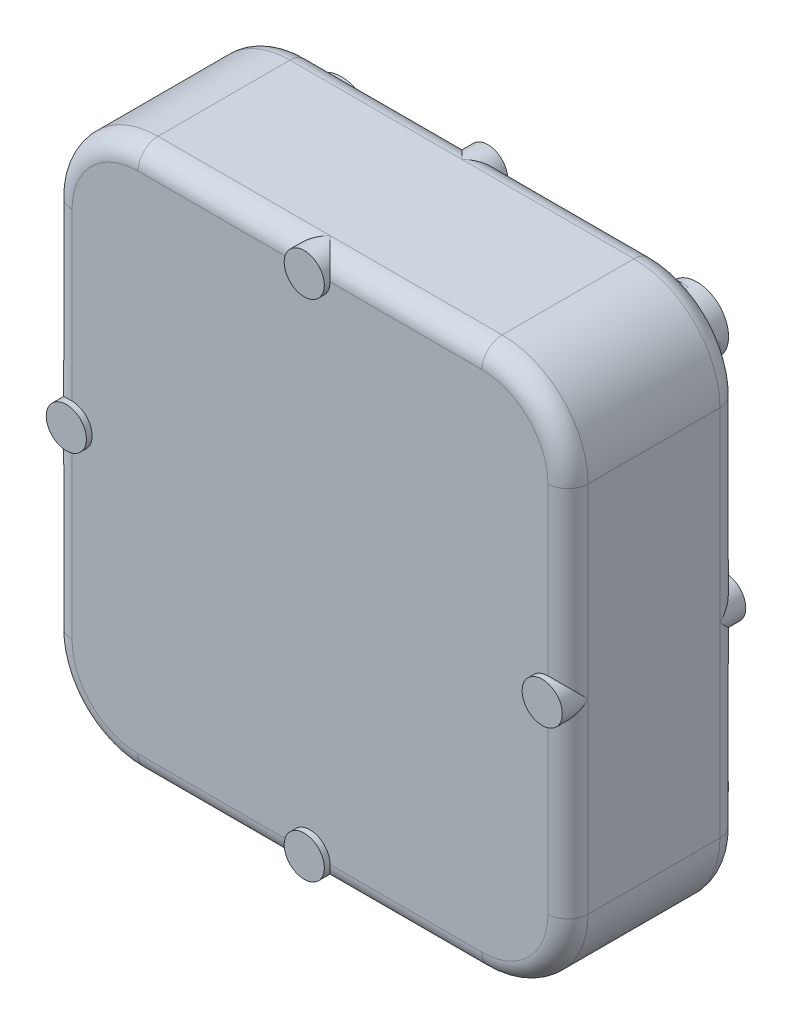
ISO-10303-21;
HEADER;
FILE_DESCRIPTION(('STEP AP214'),'2;1');
FILE_NAME('part.step','',(''),(''),'','','');
FILE_SCHEMA(('AUTOMOTIVE_DESIGN { 1 0 10303 214 1 1 1 1 }'));
ENDSEC;
DATA;
#1=APPLICATION_CONTEXT('core data for automotive mechanical design processes');
#2=APPLICATION_PROTOCOL_DEFINITION('international standard','automotive_design',2000,#1);
#3=PRODUCT_CONTEXT('',#1,'mechanical');
#4=PRODUCT('Part','Part','',(#3));
#5=PRODUCT_RELATED_PRODUCT_CATEGORY('part','',(#4));
#6=PRODUCT_DEFINITION_FORMATION('','',#4);
#7=PRODUCT_DEFINITION_CONTEXT('part definition',#1,'design');
#8=PRODUCT_DEFINITION('design','',#6,#7);
#9=PRODUCT_DEFINITION_SHAPE('','',#8);
#10=(LENGTH_UNIT() NAMED_UNIT(*) SI_UNIT(.MILLI.,.METRE.));
#11=(NAMED_UNIT(*) PLANE_ANGLE_UNIT() SI_UNIT($,.RADIAN.));
#12=(NAMED_UNIT(*) SI_UNIT($,.STERADIAN.) SOLID_ANGLE_UNIT());
#13=UNCERTAINTY_MEASURE_WITH_UNIT(LENGTH_MEASURE(1.E-05),#10,'distance_accuracy_value','');
#14=(GEOMETRIC_REPRESENTATION_CONTEXT(3) GLOBAL_UNCERTAINTY_ASSIGNED_CONTEXT((#13)) GLOBAL_UNIT_ASSIGNED_CONTEXT((#10,
#11,#12)) REPRESENTATION_CONTEXT('',''));
#15=CARTESIAN_POINT('',(0.,0.,0.));
#16=DIRECTION('',(0.,0.,1.));
#17=DIRECTION('',(1.,0.,0.));
#18=AXIS2_PLACEMENT_3D('',#15,#16,#17);
#19=CARTESIAN_POINT('',(30.,26.,-43.));
#20=DIRECTION('',(0.,0.,1.));
#21=DIRECTION('',(1.,0.,0.));
#22=AXIS2_PLACEMENT_3D('',#19,#20,#21);
#23=PLANE('',#22);
#24=CARTESIAN_POINT('',(30.,26.,-43.));
#25=DIRECTION('',(0.,0.,-1.));
#26=DIRECTION('',(-1.,0.,0.));
#27=AXIS2_PLACEMENT_3D('',#24,#25,#26);
#28=CIRCLE('',#27,22.);
#29=CARTESIAN_POINT('',(8.,26.,-43.));
#30=VERTEX_POINT('',#29);
#31=EDGE_CURVE('E1209',#30,#30,#28,.T.);
#32=ORIENTED_EDGE('',*,*,#31,.T.);
#33=EDGE_LOOP('',(#32));
#34=FACE_BOUND('',#33,.T.);
#35=CARTESIAN_POINT('',(30.,26.,-43.));
#36=DIRECTION('',(0.,0.,1.));
#37=DIRECTION('',(1.,0.,0.));
#38=AXIS2_PLACEMENT_3D('',#35,#36,#37);
#39=CIRCLE('',#38,17.5);
#40=CARTESIAN_POINT('',(47.5,26.,-43.));
#41=VERTEX_POINT('',#40);
#42=EDGE_CURVE('E11',#41,#41,#39,.F.);
#43=ORIENTED_EDGE('',*,*,#42,.F.);
#44=EDGE_LOOP('',(#43));
#45=FACE_BOUND('',#44,.T.);
#46=ADVANCED_FACE('F30',(#34,#45),#23,.F.);
#47=CARTESIAN_POINT('',(-90.,-95.,-30.));
#48=DIRECTION('',(0.,0.,1.));
#49=DIRECTION('',(1.,0.,0.));
#50=AXIS2_PLACEMENT_3D('',#47,#48,#49);
#51=PLANE('',#50);
#52=CARTESIAN_POINT('',(30.,26.,-30.));
#53=DIRECTION('',(0.,0.,-1.));
#54=DIRECTION('',(-1.,0.,0.));
#55=AXIS2_PLACEMENT_3D('',#52,#53,#54);
#56=CIRCLE('',#55,26.);
#57=CARTESIAN_POINT('',(46.2621722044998,46.286491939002,-30.));
#58=VERTEX_POINT('',#57);
#59=CARTESIAN_POINT('',(11.2976847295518,7.93834438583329,-30.));
#60=VERTEX_POINT('',#59);
#61=EDGE_CURVE('E452',#58,#60,#56,.T.);
#62=ORIENTED_EDGE('',*,*,#61,.F.);
#63=DIRECTION('',(0.673753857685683,0.738955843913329,0.));
#64=VECTOR('',#63,1.);
#65=CARTESIAN_POINT('',(2.21686753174,-2.02126157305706,-30.));
#66=LINE('',#65,#64);
#67=CARTESIAN_POINT('',(57.0865269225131,58.1583648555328,-30.));
#68=VERTEX_POINT('',#67);
#69=EDGE_CURVE('E471',#58,#68,#66,.T.);
#70=ORIENTED_EDGE('',*,*,#69,.T.);
#71=CARTESIAN_POINT('',(62.,68.,-30.));
#72=DIRECTION('',(0.,0.,1.));
#73=DIRECTION('',(-1.,0.,0.));
#74=AXIS2_PLACEMENT_3D('',#71,#72,#73);
#75=CIRCLE('',#74,11.);
#76=CARTESIAN_POINT('',(67.,58.2020410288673,-30.));
#77=VERTEX_POINT('',#76);
#78=EDGE_CURVE('E497',#68,#77,#75,.T.);
#79=ORIENTED_EDGE('',*,*,#78,.T.);
#80=DIRECTION('',(0.,1.,0.));
#81=VECTOR('',#80,1.);
#82=CARTESIAN_POINT('',(67.,68.,-30.));
#83=LINE('',#82,#81);
#84=CARTESIAN_POINT('',(67.,-58.2020410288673,-30.));
#85=VERTEX_POINT('',#84);
#86=EDGE_CURVE('E923',#85,#77,#83,.T.);
#87=ORIENTED_EDGE('',*,*,#86,.F.);
#88=CARTESIAN_POINT('',(62.,-68.,-30.));
#89=DIRECTION('',(0.,0.,1.));
#90=DIRECTION('',(1.,0.,0.));
#91=AXIS2_PLACEMENT_3D('',#88,#89,#90);
#92=CIRCLE('',#91,11.);
#93=CARTESIAN_POINT('',(57.0865269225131,-58.1583648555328,-30.));
#94=VERTEX_POINT('',#93);
#95=EDGE_CURVE('E617',#94,#85,#92,.F.);
#96=ORIENTED_EDGE('',*,*,#95,.F.);
#97=DIRECTION('',(0.673753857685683,-0.738955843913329,0.));
#98=VECTOR('',#97,1.);
#99=CARTESIAN_POINT('',(2.21686753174,2.02126157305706,-30.));
#100=LINE('',#99,#98);
#101=CARTESIAN_POINT('',(9.34720814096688,-5.79911199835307,-30.));
#102=VERTEX_POINT('',#101);
#103=EDGE_CURVE('E590',#102,#94,#100,.T.);
#104=ORIENTED_EDGE('',*,*,#103,.F.);
#105=CARTESIAN_POINT('',(0.,0.,-30.));
#106=DIRECTION('',(0.,0.,1.));
#107=DIRECTION('',(1.,0.,0.));
#108=AXIS2_PLACEMENT_3D('',#105,#106,#107);
#109=CIRCLE('',#108,11.);
#110=CARTESIAN_POINT('',(9.34720814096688,5.79911199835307,-30.));
#111=VERTEX_POINT('',#110);
#112=EDGE_CURVE('E611',#111,#102,#109,.F.);
#113=ORIENTED_EDGE('',*,*,#112,.F.);
#114=EDGE_CURVE('E474',#111,#60,#66,.T.);
#115=ORIENTED_EDGE('',*,*,#114,.T.);
#116=EDGE_LOOP('',(#62,#70,#79,#87,#96,#104,#113,#115));
#117=FACE_BOUND('',#116,.T.);
#118=ADVANCED_FACE('F849',(#117),#51,.F.);
#119=CARTESIAN_POINT('',(7.60424308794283,12.7928022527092,-30.));
#120=VERTEX_POINT('',#119);
#121=CARTESIAN_POINT('',(41.0881437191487,49.5170803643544,-30.));
#122=VERTEX_POINT('',#121);
#123=EDGE_CURVE('E444',#120,#122,#56,.T.);
#124=ORIENTED_EDGE('',*,*,#123,.F.);
#125=DIRECTION('',(-0.673753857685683,-0.738955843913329,0.));
#126=VECTOR('',#125,1.);
#127=CARTESIAN_POINT('',(59.78313246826,70.0212615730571,-30.));
#128=LINE('',#127,#126);
#129=CARTESIAN_POINT('',(4.91347307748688,9.84163514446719,-30.));
#130=VERTEX_POINT('',#129);
#131=EDGE_CURVE('E472',#120,#130,#128,.T.);
#132=ORIENTED_EDGE('',*,*,#131,.T.);
#133=CARTESIAN_POINT('',(-4.91347307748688,9.84163514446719,-30.));
#134=VERTEX_POINT('',#133);
#135=EDGE_CURVE('E851',#134,#130,#109,.F.);
#136=ORIENTED_EDGE('',*,*,#135,.F.);
#137=DIRECTION('',(0.673753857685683,-0.738955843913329,0.));
#138=VECTOR('',#137,1.);
#139=CARTESIAN_POINT('',(-59.78313246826,70.0212615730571,-30.));
#140=LINE('',#139,#138);
#141=CARTESIAN_POINT('',(-52.6527918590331,62.2008880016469,-30.));
#142=VERTEX_POINT('',#141);
#143=EDGE_CURVE('E520',#142,#134,#140,.T.);
#144=ORIENTED_EDGE('',*,*,#143,.F.);
#145=CARTESIAN_POINT('',(-62.,68.,-30.));
#146=DIRECTION('',(0.,0.,1.));
#147=DIRECTION('',(1.,0.,0.));
#148=AXIS2_PLACEMENT_3D('',#145,#146,#147);
#149=CIRCLE('',#148,11.);
#150=CARTESIAN_POINT('',(-52.2020410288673,73.,-30.));
#151=VERTEX_POINT('',#150);
#152=EDGE_CURVE('E644',#151,#142,#149,.F.);
#153=ORIENTED_EDGE('',*,*,#152,.F.);
#154=DIRECTION('',(1.,0.,0.));
#155=VECTOR('',#154,1.);
#156=CARTESIAN_POINT('',(-62.,73.,-30.));
#157=LINE('',#156,#155);
#158=CARTESIAN_POINT('',(52.2020410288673,73.,-30.));
#159=VERTEX_POINT('',#158);
#160=EDGE_CURVE('E506',#151,#159,#157,.T.);
#161=ORIENTED_EDGE('',*,*,#160,.T.);
#162=CARTESIAN_POINT('',(52.6527918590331,62.2008880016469,-30.));
#163=VERTEX_POINT('',#162);
#164=EDGE_CURVE('E470',#159,#163,#75,.T.);
#165=ORIENTED_EDGE('',*,*,#164,.T.);
#166=EDGE_CURVE('E460',#163,#122,#128,.T.);
#167=ORIENTED_EDGE('',*,*,#166,.T.);
#168=EDGE_LOOP('',(#124,#132,#136,#144,#153,#161,#165,#167));
#169=FACE_BOUND('',#168,.T.);
#170=ADVANCED_FACE('F467',(#169),#51,.F.);
#171=CARTESIAN_POINT('',(59.78313246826,70.0212615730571,-40.));
#172=DIRECTION('',(-0.738955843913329,0.673753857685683,0.));
#173=DIRECTION('',(-0.673753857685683,-0.738955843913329,0.));
#174=AXIS2_PLACEMENT_3D('',#171,#172,#173);
#175=PLANE('',#174);
#176=ORIENTED_EDGE('',*,*,#131,.F.);
#177=CARTESIAN_POINT('',(7.60419970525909,12.7927546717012,-29.9998));
#178=CARTESIAN_POINT('',(7.78507917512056,12.991138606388,-30.8336731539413));
#179=CARTESIAN_POINT('',(7.96618647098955,13.1897724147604,-31.6674375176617));
#180=CARTESIAN_POINT('',(8.3289087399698,13.5875968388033,-33.3347219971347));
#181=CARTESIAN_POINT('',(8.51052371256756,13.7867874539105,-34.1682421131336));
#182=CARTESIAN_POINT('',(8.87431375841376,14.1857829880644,-35.8350132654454));
#183=CARTESIAN_POINT('',(9.05648883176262,14.3855879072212,-36.6682643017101));
#184=CARTESIAN_POINT('',(9.42146372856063,14.7858829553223,-38.3344658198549));
#185=CARTESIAN_POINT('',(9.60426355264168,14.9863730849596,-39.16741630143));
#186=CARTESIAN_POINT('',(9.78740790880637,15.187241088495,-40.0002));
#187=B_SPLINE_CURVE_WITH_KNOTS('',3,(#177,#178,#179,#180,#181,#182,#183,#184,#185,#186),
.UNSPECIFIED.,.F.,.F.,(4,2,2,2,4),(0.,2.62807195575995,5.2561412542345,7.88421102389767,
10.5122834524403),.UNSPECIFIED.);
#188=CARTESIAN_POINT('',(9.7873639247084,15.1871928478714,-40.));
#189=VERTEX_POINT('',#188);
#190=EDGE_CURVE('E448',#120,#189,#187,.T.);
#191=ORIENTED_EDGE('',*,*,#190,.T.);
#192=DIRECTION('',(-0.673753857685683,-0.738955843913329,0.));
#193=VECTOR('',#192,1.);
#194=CARTESIAN_POINT('',(59.78313246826,70.0212615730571,-40.));
#195=LINE('',#194,#193);
#196=CARTESIAN_POINT('',(4.91347307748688,9.84163514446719,-40.));
#197=VERTEX_POINT('',#196);
#198=EDGE_CURVE('E481',#189,#197,#195,.T.);
#199=ORIENTED_EDGE('',*,*,#198,.T.);
#200=DIRECTION('',(0.,0.,1.));
#201=VECTOR('',#200,1.);
#202=CARTESIAN_POINT('',(4.91347307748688,9.84163514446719,-43.));
#203=LINE('',#202,#201);
#204=EDGE_CURVE('E491',#130,#197,#203,.F.);
#205=ORIENTED_EDGE('',*,*,#204,.F.);
#206=EDGE_LOOP('',(#176,#191,#199,#205));
#207=FACE_BOUND('',#206,.T.);
#208=ADVANCED_FACE('F1186',(#207),#175,.T.);
#209=CARTESIAN_POINT('',(52.6527918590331,62.2008880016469,-40.));
#210=VERTEX_POINT('',#209);
#211=CARTESIAN_POINT('',(38.9050228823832,47.1226897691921,-40.));
#212=VERTEX_POINT('',#211);
#213=EDGE_CURVE('E462',#210,#212,#195,.T.);
#214=ORIENTED_EDGE('',*,*,#213,.T.);
#215=CARTESIAN_POINT('',(38.9049788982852,47.1226415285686,-40.0002));
#216=CARTESIAN_POINT('',(39.0881232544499,47.323509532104,-39.16741630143));
#217=CARTESIAN_POINT('',(39.2709230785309,47.5239996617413,-38.3344658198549));
#218=CARTESIAN_POINT('',(39.6358979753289,47.9242947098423,-36.6682643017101));
#219=CARTESIAN_POINT('',(39.8180730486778,48.1240996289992,-35.8350132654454));
#220=CARTESIAN_POINT('',(40.181863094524,48.5230951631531,-34.1682421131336));
#221=CARTESIAN_POINT('',(40.3634780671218,48.7222857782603,-33.3347219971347));
#222=CARTESIAN_POINT('',(40.726200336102,49.1201102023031,-31.6674375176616));
#223=CARTESIAN_POINT('',(40.907307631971,49.3187440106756,-30.8336731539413));
#224=CARTESIAN_POINT('',(41.0881871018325,49.5171279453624,-29.9998));
#225=B_SPLINE_CURVE_WITH_KNOTS('',3,(#215,#216,#217,#218,#219,#220,#221,#222,#223,#224),
.UNSPECIFIED.,.F.,.F.,(4,2,2,2,4),(0.,2.6280724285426,5.25614219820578,7.88421149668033,
10.5122834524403),.UNSPECIFIED.);
#226=EDGE_CURVE('E45',#212,#122,#225,.T.);
#227=ORIENTED_EDGE('',*,*,#226,.T.);
#228=ORIENTED_EDGE('',*,*,#166,.F.);
#229=DIRECTION('',(0.,0.,1.));
#230=VECTOR('',#229,1.);
#231=CARTESIAN_POINT('',(52.6527918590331,62.2008880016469,-74.1126983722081));
#232=LINE('',#231,#230);
#233=EDGE_CURVE('E670',#163,#210,#232,.F.);
#234=ORIENTED_EDGE('',*,*,#233,.T.);
#235=EDGE_LOOP('',(#214,#227,#228,#234));
#236=FACE_BOUND('',#235,.T.);
#237=ADVANCED_FACE('F458',(#236),#175,.T.);
#238=CARTESIAN_POINT('',(2.21686753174,-2.02126157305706,-40.));
#239=DIRECTION('',(0.738955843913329,-0.673753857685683,0.));
#240=DIRECTION('',(0.673753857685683,0.738955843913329,0.));
#241=AXIS2_PLACEMENT_3D('',#238,#239,#240);
#242=PLANE('',#241);
#243=ORIENTED_EDGE('',*,*,#69,.F.);
#244=CARTESIAN_POINT('',(46.2622137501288,46.2865375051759,-29.9998));
#245=CARTESIAN_POINT('',(45.9159835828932,45.9068011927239,-31.6665751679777));
#246=CARTESIAN_POINT('',(45.5697077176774,45.5270147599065,-33.3333294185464));
#247=CARTESIAN_POINT('',(44.877064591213,44.7673416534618,-36.6667960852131));
#248=CARTESIAN_POINT('',(44.5306973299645,44.3874549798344,-38.3335085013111));
#249=CARTESIAN_POINT('',(44.1842843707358,44.0075181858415,-40.0002));
#250=B_SPLINE_CURVE_WITH_KNOTS('',3,(#244,#245,#246,#247,#248,#249),.UNSPECIFIED.,.F.,.F.,(4,2,
4),(0.,5.23258348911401,10.465166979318),.UNSPECIFIED.);
#251=CARTESIAN_POINT('',(44.184325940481,44.0075637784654,-40.));
#252=VERTEX_POINT('',#251);
#253=EDGE_CURVE('E464',#58,#252,#250,.T.);
#254=ORIENTED_EDGE('',*,*,#253,.T.);
#255=DIRECTION('',(0.673753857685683,0.738955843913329,0.));
#256=VECTOR('',#255,1.);
#257=CARTESIAN_POINT('',(2.21686753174,-2.02126157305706,-40.));
#258=LINE('',#257,#256);
#259=CARTESIAN_POINT('',(57.0865269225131,58.1583648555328,-40.));
#260=VERTEX_POINT('',#259);
#261=EDGE_CURVE('E483',#252,#260,#258,.T.);
#262=ORIENTED_EDGE('',*,*,#261,.T.);
#263=DIRECTION('',(0.,0.,1.));
#264=VECTOR('',#263,1.);
#265=CARTESIAN_POINT('',(57.0865269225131,58.1583648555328,-74.1126983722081));
#266=LINE('',#265,#264);
#267=EDGE_CURVE('E667',#260,#68,#266,.T.);
#268=ORIENTED_EDGE('',*,*,#267,.T.);
#269=EDGE_LOOP('',(#243,#254,#262,#268));
#270=FACE_BOUND('',#269,.T.);
#271=ADVANCED_FACE('F1210',(#270),#242,.T.);
#272=CARTESIAN_POINT('',(9.34720814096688,5.79911199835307,-40.));
#273=VERTEX_POINT('',#272);
#274=CARTESIAN_POINT('',(13.3755309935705,10.21727254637,-40.));
#275=VERTEX_POINT('',#274);
#276=EDGE_CURVE('E484',#273,#275,#258,.T.);
#277=ORIENTED_EDGE('',*,*,#276,.T.);
#278=CARTESIAN_POINT('',(13.3755725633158,10.2173181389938,-40.0002));
#279=CARTESIAN_POINT('',(13.029159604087,9.83738134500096,-38.3335085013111));
#280=CARTESIAN_POINT('',(12.6827923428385,9.45749467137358,-36.6667960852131));
#281=CARTESIAN_POINT('',(11.9901492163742,8.69782156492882,-33.3333294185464));
#282=CARTESIAN_POINT('',(11.6438733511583,8.31803513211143,-31.6665751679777));
#283=CARTESIAN_POINT('',(11.2976431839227,7.93829881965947,-29.9998));
#284=B_SPLINE_CURVE_WITH_KNOTS('',3,(#278,#279,#280,#281,#282,#283),.UNSPECIFIED.,.F.,.F.,(4,2,
4),(0.,5.232583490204,10.465166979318),.UNSPECIFIED.);
#285=EDGE_CURVE('E463',#275,#60,#284,.T.);
#286=ORIENTED_EDGE('',*,*,#285,.T.);
#287=ORIENTED_EDGE('',*,*,#114,.F.);
#288=DIRECTION('',(0.,0.,1.));
#289=VECTOR('',#288,1.);
#290=CARTESIAN_POINT('',(9.34720814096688,5.79911199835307,-43.));
#291=LINE('',#290,#289);
#292=EDGE_CURVE('E489',#273,#111,#291,.T.);
#293=ORIENTED_EDGE('',*,*,#292,.F.);
#294=EDGE_LOOP('',(#277,#286,#287,#293));
#295=FACE_BOUND('',#294,.T.);
#296=ADVANCED_FACE('F838',(#295),#242,.T.);
#297=CARTESIAN_POINT('',(-2.21686753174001,2.02126157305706,-40.));
#298=DIRECTION('',(0.,0.,-1.));
#299=DIRECTION('',(-1.,0.,0.));
#300=AXIS2_PLACEMENT_3D('',#297,#298,#299);
#301=PLANE('',#300);
#302=ORIENTED_EDGE('',*,*,#198,.F.);
#303=CARTESIAN_POINT('',(30.,26.,-40.));
#304=DIRECTION('',(0.,0.,-1.));
#305=DIRECTION('',(-1.,0.,0.));
#306=AXIS2_PLACEMENT_3D('',#303,#304,#305);
#307=CIRCLE('',#306,22.9230769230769);
#308=EDGE_CURVE('E38',#189,#275,#307,.F.);
#309=ORIENTED_EDGE('',*,*,#308,.T.);
#310=ORIENTED_EDGE('',*,*,#276,.F.);
#311=CARTESIAN_POINT('',(0.,0.,-40.));
#312=DIRECTION('',(0.,0.,-1.));
#313=DIRECTION('',(-1.,0.,0.));
#314=AXIS2_PLACEMENT_3D('',#311,#312,#313);
#315=CIRCLE('',#314,11.);
#316=EDGE_CURVE('E487',#197,#273,#315,.T.);
#317=ORIENTED_EDGE('',*,*,#316,.F.);
#318=EDGE_LOOP('',(#302,#309,#310,#317));
#319=FACE_BOUND('',#318,.T.);
#320=ADVANCED_FACE('F833',(#319),#301,.T.);
#321=ORIENTED_EDGE('',*,*,#261,.F.);
#322=EDGE_CURVE('E826',#252,#212,#307,.F.);
#323=ORIENTED_EDGE('',*,*,#322,.T.);
#324=ORIENTED_EDGE('',*,*,#213,.F.);
#325=CARTESIAN_POINT('',(62.,68.,-40.));
#326=DIRECTION('',(0.,0.,-1.));
#327=DIRECTION('',(-1.,0.,0.));
#328=AXIS2_PLACEMENT_3D('',#325,#326,#327);
#329=CIRCLE('',#328,11.);
#330=EDGE_CURVE('E664',#210,#260,#329,.F.);
#331=ORIENTED_EDGE('',*,*,#330,.T.);
#332=EDGE_LOOP('',(#321,#323,#324,#331));
#333=FACE_BOUND('',#332,.T.);
#334=ADVANCED_FACE('F1218',(#333),#301,.T.);
#335=CARTESIAN_POINT('',(-73.,68.,-30.));
#336=VERTEX_POINT('',#335);
#337=CARTESIAN_POINT('',(-62.,79.,-30.));
#338=VERTEX_POINT('',#337);
#339=EDGE_CURVE('E649',#336,#338,#149,.F.);
#340=ORIENTED_EDGE('',*,*,#339,.F.);
#341=DIRECTION('',(0.,-1.,0.));
#342=VECTOR('',#341,1.);
#343=CARTESIAN_POINT('',(-73.,68.,-30.));
#344=LINE('',#343,#342);
#345=CARTESIAN_POINT('',(-73.,-68.,-30.));
#346=VERTEX_POINT('',#345);
#347=EDGE_CURVE('E902',#336,#346,#344,.T.);
#348=ORIENTED_EDGE('',*,*,#347,.T.);
#349=CARTESIAN_POINT('',(-62.,-68.,-30.));
#350=DIRECTION('',(0.,0.,1.));
#351=DIRECTION('',(1.,0.,0.));
#352=AXIS2_PLACEMENT_3D('',#349,#350,#351);
#353=CIRCLE('',#352,11.);
#354=CARTESIAN_POINT('',(-62.,-79.,-30.));
#355=VERTEX_POINT('',#354);
#356=EDGE_CURVE('E585',#346,#355,#353,.T.);
#357=ORIENTED_EDGE('',*,*,#356,.T.);
#358=DIRECTION('',(-1.,0.,0.));
#359=VECTOR('',#358,1.);
#360=CARTESIAN_POINT('',(-62.,-79.,-30.));
#361=LINE('',#360,#359);
#362=CARTESIAN_POINT('',(62.,-79.,-30.));
#363=VERTEX_POINT('',#362);
#364=EDGE_CURVE('E542',#363,#355,#361,.T.);
#365=ORIENTED_EDGE('',*,*,#364,.F.);
#366=CARTESIAN_POINT('',(73.,-68.,-30.));
#367=VERTEX_POINT('',#366);
#368=EDGE_CURVE('E621',#367,#363,#92,.F.);
#369=ORIENTED_EDGE('',*,*,#368,.F.);
#370=DIRECTION('',(0.,-1.,0.));
#371=VECTOR('',#370,1.);
#372=CARTESIAN_POINT('',(73.,68.,-30.));
#373=LINE('',#372,#371);
#374=CARTESIAN_POINT('',(73.,68.,-30.));
#375=VERTEX_POINT('',#374);
#376=EDGE_CURVE('E924',#375,#367,#373,.T.);
#377=ORIENTED_EDGE('',*,*,#376,.F.);
#378=CARTESIAN_POINT('',(62.,79.,-30.));
#379=VERTEX_POINT('',#378);
#380=EDGE_CURVE('E494',#375,#379,#75,.T.);
#381=ORIENTED_EDGE('',*,*,#380,.T.);
#382=DIRECTION('',(-1.,0.,0.));
#383=VECTOR('',#382,1.);
#384=CARTESIAN_POINT('',(-62.,79.,-30.));
#385=LINE('',#384,#383);
#386=EDGE_CURVE('E508',#379,#338,#385,.T.);
#387=ORIENTED_EDGE('',*,*,#386,.T.);
#388=EDGE_LOOP('',(#340,#348,#357,#365,#369,#377,#381,#387));
#389=FACE_BOUND('',#388,.T.);
#390=CARTESIAN_POINT('',(0.,-88.,-30.));
#391=DIRECTION('',(0.,0.,1.));
#392=DIRECTION('',(1.,0.,0.));
#393=AXIS2_PLACEMENT_3D('',#390,#391,#392);
#394=CIRCLE('',#393,7.);
#395=CARTESIAN_POINT('',(-7.00000000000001,-88.,-30.));
#396=VERTEX_POINT('',#395);
#397=CARTESIAN_POINT('',(6.99999999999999,-88.,-30.));
#398=VERTEX_POINT('',#397);
#399=EDGE_CURVE('E53',#396,#398,#394,.F.);
#400=ORIENTED_EDGE('',*,*,#399,.F.);
#401=DIRECTION('',(1.,0.,0.));
#402=VECTOR('',#401,1.);
#403=CARTESIAN_POINT('',(-90.,-88.,-30.));
#404=LINE('',#403,#402);
#405=CARTESIAN_POINT('',(-60.,-88.,-30.));
#406=VERTEX_POINT('',#405);
#407=EDGE_CURVE('E715',#396,#406,#404,.F.);
#408=ORIENTED_EDGE('',*,*,#407,.T.);
#409=CARTESIAN_POINT('',(-60.,-65.,-30.));
#410=DIRECTION('',(0.,0.,1.));
#411=DIRECTION('',(1.,0.,0.));
#412=AXIS2_PLACEMENT_3D('',#409,#410,#411);
#413=CIRCLE('',#412,23.);
#414=CARTESIAN_POINT('',(-83.,-65.,-30.));
#415=VERTEX_POINT('',#414);
#416=EDGE_CURVE('E721',#406,#415,#413,.F.);
#417=ORIENTED_EDGE('',*,*,#416,.T.);
#418=DIRECTION('',(0.,-1.,0.));
#419=VECTOR('',#418,1.);
#420=CARTESIAN_POINT('',(-83.,-95.,-30.));
#421=LINE('',#420,#419);
#422=CARTESIAN_POINT('',(-83.,-6.99999999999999,-30.));
#423=VERTEX_POINT('',#422);
#424=EDGE_CURVE('E728',#415,#423,#421,.F.);
#425=ORIENTED_EDGE('',*,*,#424,.T.);
#426=CARTESIAN_POINT('',(-83.,0.,-30.));
#427=DIRECTION('',(0.,0.,1.));
#428=DIRECTION('',(1.,0.,0.));
#429=AXIS2_PLACEMENT_3D('',#426,#427,#428);
#430=CIRCLE('',#429,7.);
#431=CARTESIAN_POINT('',(-83.,7.00000000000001,-30.));
#432=VERTEX_POINT('',#431);
#433=EDGE_CURVE('E1144',#432,#423,#430,.F.);
#434=ORIENTED_EDGE('',*,*,#433,.F.);
#435=CARTESIAN_POINT('',(-83.,65.,-30.));
#436=VERTEX_POINT('',#435);
#437=EDGE_CURVE('E727',#432,#436,#421,.F.);
#438=ORIENTED_EDGE('',*,*,#437,.T.);
#439=CARTESIAN_POINT('',(-60.,65.,-30.));
#440=DIRECTION('',(0.,0.,1.));
#441=DIRECTION('',(1.,0.,0.));
#442=AXIS2_PLACEMENT_3D('',#439,#440,#441);
#443=CIRCLE('',#442,23.);
#444=CARTESIAN_POINT('',(-60.,88.,-30.));
#445=VERTEX_POINT('',#444);
#446=EDGE_CURVE('E733',#436,#445,#443,.F.);
#447=ORIENTED_EDGE('',*,*,#446,.T.);
#448=DIRECTION('',(-1.,0.,0.));
#449=VECTOR('',#448,1.);
#450=CARTESIAN_POINT('',(-90.,88.,-30.));
#451=LINE('',#450,#449);
#452=CARTESIAN_POINT('',(-7.00000000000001,88.,-30.));
#453=VERTEX_POINT('',#452);
#454=EDGE_CURVE('E736',#445,#453,#451,.F.);
#455=ORIENTED_EDGE('',*,*,#454,.T.);
#456=CARTESIAN_POINT('',(0.,88.,-30.));
#457=DIRECTION('',(0.,0.,1.));
#458=DIRECTION('',(1.,0.,0.));
#459=AXIS2_PLACEMENT_3D('',#456,#457,#458);
#460=CIRCLE('',#459,7.);
#461=CARTESIAN_POINT('',(6.99999999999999,88.,-30.));
#462=VERTEX_POINT('',#461);
#463=EDGE_CURVE('E1127',#462,#453,#460,.F.);
#464=ORIENTED_EDGE('',*,*,#463,.F.);
#465=CARTESIAN_POINT('',(60.,88.,-30.));
#466=VERTEX_POINT('',#465);
#467=EDGE_CURVE('E735',#462,#466,#451,.F.);
#468=ORIENTED_EDGE('',*,*,#467,.T.);
#469=CARTESIAN_POINT('',(60.,65.,-30.));
#470=DIRECTION('',(0.,0.,1.));
#471=DIRECTION('',(1.,0.,0.));
#472=AXIS2_PLACEMENT_3D('',#469,#470,#471);
#473=CIRCLE('',#472,23.);
#474=CARTESIAN_POINT('',(83.,65.,-30.));
#475=VERTEX_POINT('',#474);
#476=EDGE_CURVE('E731',#466,#475,#473,.F.);
#477=ORIENTED_EDGE('',*,*,#476,.T.);
#478=DIRECTION('',(0.,1.,0.));
#479=VECTOR('',#478,1.);
#480=CARTESIAN_POINT('',(83.,-95.,-30.));
#481=LINE('',#480,#479);
#482=CARTESIAN_POINT('',(82.9999999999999,7.00000000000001,-30.));
#483=VERTEX_POINT('',#482);
#484=EDGE_CURVE('E724',#475,#483,#481,.F.);
#485=ORIENTED_EDGE('',*,*,#484,.T.);
#486=CARTESIAN_POINT('',(83.,0.,-30.));
#487=DIRECTION('',(0.,0.,1.));
#488=DIRECTION('',(1.,0.,0.));
#489=AXIS2_PLACEMENT_3D('',#486,#487,#488);
#490=CIRCLE('',#489,7.);
#491=CARTESIAN_POINT('',(83.,-6.99999999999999,-30.));
#492=VERTEX_POINT('',#491);
#493=EDGE_CURVE('E1110',#492,#483,#490,.F.);
#494=ORIENTED_EDGE('',*,*,#493,.F.);
#495=CARTESIAN_POINT('',(83.,-65.,-30.));
#496=VERTEX_POINT('',#495);
#497=EDGE_CURVE('E723',#492,#496,#481,.F.);
#498=ORIENTED_EDGE('',*,*,#497,.T.);
#499=CARTESIAN_POINT('',(60.,-65.,-30.));
#500=DIRECTION('',(0.,0.,1.));
#501=DIRECTION('',(1.,0.,0.));
#502=AXIS2_PLACEMENT_3D('',#499,#500,#501);
#503=CIRCLE('',#502,23.);
#504=CARTESIAN_POINT('',(60.,-88.,-30.));
#505=VERTEX_POINT('',#504);
#506=EDGE_CURVE('E719',#496,#505,#503,.F.);
#507=ORIENTED_EDGE('',*,*,#506,.T.);
#508=EDGE_CURVE('E716',#505,#398,#404,.F.);
#509=ORIENTED_EDGE('',*,*,#508,.T.);
#510=EDGE_LOOP('',(#400,#408,#417,#425,#434,#438,#447,#455,#464,#468,#477,#485,#494,#498,#507,#509));
#511=FACE_BOUND('',#510,.T.);
#512=ADVANCED_FACE('F898',(#389,#511),#51,.F.);
#513=CARTESIAN_POINT('',(-90.,-95.,30.));
#514=DIRECTION('',(0.,0.,1.));
#515=DIRECTION('',(1.,0.,0.));
#516=AXIS2_PLACEMENT_3D('',#513,#514,#515);
#517=PLANE('',#516);
#518=DIRECTION('',(1.,0.,0.));
#519=VECTOR('',#518,1.);
#520=CARTESIAN_POINT('',(60.,-88.,30.));
#521=LINE('',#520,#519);
#522=CARTESIAN_POINT('',(-60.,-88.,30.));
#523=VERTEX_POINT('',#522);
#524=CARTESIAN_POINT('',(-6.99999999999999,-88.,30.));
#525=VERTEX_POINT('',#524);
#526=EDGE_CURVE('E740',#523,#525,#521,.T.);
#527=ORIENTED_EDGE('',*,*,#526,.T.);
#528=CARTESIAN_POINT('',(0.,-88.,30.));
#529=DIRECTION('',(0.,0.,1.));
#530=DIRECTION('',(1.,0.,0.));
#531=AXIS2_PLACEMENT_3D('',#528,#529,#530);
#532=CIRCLE('',#531,7.);
#533=CARTESIAN_POINT('',(7.,-88.,30.));
#534=VERTEX_POINT('',#533);
#535=EDGE_CURVE('E1167',#525,#534,#532,.F.);
#536=ORIENTED_EDGE('',*,*,#535,.T.);
#537=CARTESIAN_POINT('',(60.,-88.,30.));
#538=VERTEX_POINT('',#537);
#539=EDGE_CURVE('E739',#534,#538,#521,.T.);
#540=ORIENTED_EDGE('',*,*,#539,.T.);
#541=CARTESIAN_POINT('',(60.,-65.,30.));
#542=DIRECTION('',(0.,0.,1.));
#543=DIRECTION('',(1.,0.,0.));
#544=AXIS2_PLACEMENT_3D('',#541,#542,#543);
#545=CIRCLE('',#544,23.);
#546=CARTESIAN_POINT('',(83.,-65.,30.));
#547=VERTEX_POINT('',#546);
#548=EDGE_CURVE('E743',#538,#547,#545,.T.);
#549=ORIENTED_EDGE('',*,*,#548,.T.);
#550=DIRECTION('',(0.,1.,0.));
#551=VECTOR('',#550,1.);
#552=CARTESIAN_POINT('',(82.9999999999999,65.,30.));
#553=LINE('',#552,#551);
#554=CARTESIAN_POINT('',(82.9999999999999,-7.00000000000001,30.));
#555=VERTEX_POINT('',#554);
#556=EDGE_CURVE('E748',#547,#555,#553,.T.);
#557=ORIENTED_EDGE('',*,*,#556,.T.);
#558=CARTESIAN_POINT('',(83.,0.,30.));
#559=DIRECTION('',(0.,0.,1.));
#560=DIRECTION('',(1.,0.,0.));
#561=AXIS2_PLACEMENT_3D('',#558,#559,#560);
#562=CIRCLE('',#561,7.);
#563=CARTESIAN_POINT('',(82.9999999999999,6.99999999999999,30.));
#564=VERTEX_POINT('',#563);
#565=EDGE_CURVE('E1118',#555,#564,#562,.F.);
#566=ORIENTED_EDGE('',*,*,#565,.T.);
#567=CARTESIAN_POINT('',(82.9999999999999,65.,30.));
#568=VERTEX_POINT('',#567);
#569=EDGE_CURVE('E747',#564,#568,#553,.T.);
#570=ORIENTED_EDGE('',*,*,#569,.T.);
#571=CARTESIAN_POINT('',(60.,65.,30.));
#572=DIRECTION('',(0.,0.,1.));
#573=DIRECTION('',(1.,0.,0.));
#574=AXIS2_PLACEMENT_3D('',#571,#572,#573);
#575=CIRCLE('',#574,23.);
#576=CARTESIAN_POINT('',(60.,88.,30.));
#577=VERTEX_POINT('',#576);
#578=EDGE_CURVE('E755',#568,#577,#575,.T.);
#579=ORIENTED_EDGE('',*,*,#578,.T.);
#580=DIRECTION('',(-1.,0.,0.));
#581=VECTOR('',#580,1.);
#582=CARTESIAN_POINT('',(-60.,88.,30.));
#583=LINE('',#582,#581);
#584=CARTESIAN_POINT('',(6.99999999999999,88.,30.));
#585=VERTEX_POINT('',#584);
#586=EDGE_CURVE('E760',#577,#585,#583,.T.);
#587=ORIENTED_EDGE('',*,*,#586,.T.);
#588=CARTESIAN_POINT('',(0.,88.,30.));
#589=DIRECTION('',(0.,0.,1.));
#590=DIRECTION('',(1.,0.,0.));
#591=AXIS2_PLACEMENT_3D('',#588,#589,#590);
#592=CIRCLE('',#591,7.);
#593=CARTESIAN_POINT('',(-7.,88.,30.));
#594=VERTEX_POINT('',#593);
#595=EDGE_CURVE('E1135',#585,#594,#592,.F.);
#596=ORIENTED_EDGE('',*,*,#595,.T.);
#597=CARTESIAN_POINT('',(-60.,88.,30.));
#598=VERTEX_POINT('',#597);
#599=EDGE_CURVE('E759',#594,#598,#583,.T.);
#600=ORIENTED_EDGE('',*,*,#599,.T.);
#601=CARTESIAN_POINT('',(-60.,65.,30.));
#602=DIRECTION('',(0.,0.,1.));
#603=DIRECTION('',(1.,0.,0.));
#604=AXIS2_PLACEMENT_3D('',#601,#602,#603);
#605=CIRCLE('',#604,23.);
#606=CARTESIAN_POINT('',(-83.,65.,30.));
#607=VERTEX_POINT('',#606);
#608=EDGE_CURVE('E757',#598,#607,#605,.T.);
#609=ORIENTED_EDGE('',*,*,#608,.T.);
#610=DIRECTION('',(0.,-1.,0.));
#611=VECTOR('',#610,1.);
#612=CARTESIAN_POINT('',(-83.,-65.,30.));
#613=LINE('',#612,#611);
#614=CARTESIAN_POINT('',(-83.,6.99999999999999,30.));
#615=VERTEX_POINT('',#614);
#616=EDGE_CURVE('E752',#607,#615,#613,.T.);
#617=ORIENTED_EDGE('',*,*,#616,.T.);
#618=CARTESIAN_POINT('',(-83.,0.,30.));
#619=DIRECTION('',(0.,0.,1.));
#620=DIRECTION('',(1.,0.,0.));
#621=AXIS2_PLACEMENT_3D('',#618,#619,#620);
#622=CIRCLE('',#621,7.);
#623=CARTESIAN_POINT('',(-83.,-7.,30.));
#624=VERTEX_POINT('',#623);
#625=EDGE_CURVE('E1152',#615,#624,#622,.F.);
#626=ORIENTED_EDGE('',*,*,#625,.T.);
#627=CARTESIAN_POINT('',(-83.,-65.,30.));
#628=VERTEX_POINT('',#627);
#629=EDGE_CURVE('E751',#624,#628,#613,.T.);
#630=ORIENTED_EDGE('',*,*,#629,.T.);
#631=CARTESIAN_POINT('',(-60.,-65.,30.));
#632=DIRECTION('',(0.,0.,1.));
#633=DIRECTION('',(1.,0.,0.));
#634=AXIS2_PLACEMENT_3D('',#631,#632,#633);
#635=CIRCLE('',#634,23.);
#636=EDGE_CURVE('E745',#628,#523,#635,.T.);
#637=ORIENTED_EDGE('',*,*,#636,.T.);
#638=EDGE_LOOP('',(#527,#536,#540,#549,#557,#566,#570,#579,#587,#596,#600,#609,#617,#626,#630,#637));
#639=FACE_BOUND('',#638,.T.);
#640=ADVANCED_FACE('F1333',(#639),#517,.T.);
#641=CARTESIAN_POINT('',(-90.,-88.,-23.));
#642=DIRECTION('',(1.,0.,0.));
#643=DIRECTION('',(0.,0.,-1.));
#644=AXIS2_PLACEMENT_3D('',#641,#642,#643);
#645=CYLINDRICAL_SURFACE('',#644,7.);
#646=ORIENTED_EDGE('',*,*,#407,.F.);
#647=CARTESIAN_POINT('',(0.,-88.,-23.));
#648=DIRECTION('',(0.707106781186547,0.,-0.707106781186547));
#649=DIRECTION('',(0.707106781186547,0.,0.707106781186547));
#650=AXIS2_PLACEMENT_3D('',#647,#648,#649);
#651=ELLIPSE('',#650,9.89949493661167,7.);
#652=CARTESIAN_POINT('',(0.,-95.,-23.));
#653=VERTEX_POINT('',#652);
#654=EDGE_CURVE('E1162',#396,#653,#651,.F.);
#655=ORIENTED_EDGE('',*,*,#654,.T.);
#656=DIRECTION('',(1.,0.,0.));
#657=VECTOR('',#656,1.);
#658=CARTESIAN_POINT('',(-90.,-95.,-23.));
#659=LINE('',#658,#657);
#660=CARTESIAN_POINT('',(-60.,-95.,-23.));
#661=VERTEX_POINT('',#660);
#662=EDGE_CURVE('E800',#661,#653,#659,.T.);
#663=ORIENTED_EDGE('',*,*,#662,.F.);
#664=CARTESIAN_POINT('',(-60.,-88.,-23.));
#665=DIRECTION('',(-1.,0.,0.));
#666=DIRECTION('',(0.,0.,1.));
#667=AXIS2_PLACEMENT_3D('',#664,#665,#666);
#668=CIRCLE('',#667,7.);
#669=EDGE_CURVE('E1065',#406,#661,#668,.T.);
#670=ORIENTED_EDGE('',*,*,#669,.F.);
#671=EDGE_LOOP('',(#646,#655,#663,#670));
#672=FACE_BOUND('',#671,.T.);
#673=ADVANCED_FACE('F1329',(#672),#645,.T.);
#674=CARTESIAN_POINT('',(60.,-95.,-23.));
#675=VERTEX_POINT('',#674);
#676=EDGE_CURVE('E799',#653,#675,#659,.T.);
#677=ORIENTED_EDGE('',*,*,#676,.F.);
#678=CARTESIAN_POINT('',(0.,-88.,-23.));
#679=DIRECTION('',(0.707106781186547,0.,0.707106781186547));
#680=DIRECTION('',(0.707106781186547,0.,-0.707106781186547));
#681=AXIS2_PLACEMENT_3D('',#678,#679,#680);
#682=ELLIPSE('',#681,9.89949493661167,7.);
#683=EDGE_CURVE('E1165',#653,#398,#682,.T.);
#684=ORIENTED_EDGE('',*,*,#683,.T.);
#685=ORIENTED_EDGE('',*,*,#508,.F.);
#686=CARTESIAN_POINT('',(60.,-88.,-23.));
#687=DIRECTION('',(1.,0.,0.));
#688=DIRECTION('',(0.,0.,-1.));
#689=AXIS2_PLACEMENT_3D('',#686,#687,#688);
#690=CIRCLE('',#689,7.);
#691=EDGE_CURVE('E1062',#675,#505,#690,.T.);
#692=ORIENTED_EDGE('',*,*,#691,.F.);
#693=EDGE_LOOP('',(#677,#684,#685,#692));
#694=FACE_BOUND('',#693,.T.);
#695=ADVANCED_FACE('F1332',(#694),#645,.T.);
#696=CARTESIAN_POINT('',(-90.,-88.,23.));
#697=DIRECTION('',(-1.,0.,0.));
#698=DIRECTION('',(0.,0.,1.));
#699=AXIS2_PLACEMENT_3D('',#696,#697,#698);
#700=CYLINDRICAL_SURFACE('',#699,7.);
#701=DIRECTION('',(1.,0.,0.));
#702=VECTOR('',#701,1.);
#703=CARTESIAN_POINT('',(-60.,-95.,23.));
#704=LINE('',#703,#702);
#705=CARTESIAN_POINT('',(0.,-95.,23.));
#706=VERTEX_POINT('',#705);
#707=CARTESIAN_POINT('',(-60.,-95.,23.));
#708=VERTEX_POINT('',#707);
#709=EDGE_CURVE('E795',#706,#708,#704,.F.);
#710=ORIENTED_EDGE('',*,*,#709,.F.);
#711=CARTESIAN_POINT('',(0.,-88.,23.));
#712=DIRECTION('',(-0.707106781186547,0.,-0.707106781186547));
#713=DIRECTION('',(-0.707106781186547,0.,0.707106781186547));
#714=AXIS2_PLACEMENT_3D('',#711,#712,#713);
#715=ELLIPSE('',#714,9.89949493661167,7.);
#716=EDGE_CURVE('E824',#706,#525,#715,.T.);
#717=ORIENTED_EDGE('',*,*,#716,.T.);
#718=ORIENTED_EDGE('',*,*,#526,.F.);
#719=CARTESIAN_POINT('',(-60.,-88.,23.));
#720=DIRECTION('',(-1.,0.,0.));
#721=DIRECTION('',(0.,0.,1.));
#722=AXIS2_PLACEMENT_3D('',#719,#720,#721);
#723=CIRCLE('',#722,7.);
#724=EDGE_CURVE('E1089',#708,#523,#723,.T.);
#725=ORIENTED_EDGE('',*,*,#724,.F.);
#726=EDGE_LOOP('',(#710,#717,#718,#725));
#727=FACE_BOUND('',#726,.T.);
#728=ADVANCED_FACE('F1369',(#727),#700,.T.);
#729=ORIENTED_EDGE('',*,*,#539,.F.);
#730=CARTESIAN_POINT('',(0.,-88.,23.));
#731=DIRECTION('',(-0.707106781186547,0.,0.707106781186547));
#732=DIRECTION('',(-0.707106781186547,0.,-0.707106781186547));
#733=AXIS2_PLACEMENT_3D('',#730,#731,#732);
#734=ELLIPSE('',#733,9.89949493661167,7.);
#735=EDGE_CURVE('E821',#534,#706,#734,.F.);
#736=ORIENTED_EDGE('',*,*,#735,.T.);
#737=CARTESIAN_POINT('',(60.,-95.,23.));
#738=VERTEX_POINT('',#737);
#739=EDGE_CURVE('E796',#738,#706,#704,.F.);
#740=ORIENTED_EDGE('',*,*,#739,.F.);
#741=CARTESIAN_POINT('',(60.,-88.,23.));
#742=DIRECTION('',(1.,0.,0.));
#743=DIRECTION('',(0.,0.,-1.));
#744=AXIS2_PLACEMENT_3D('',#741,#742,#743);
#745=CIRCLE('',#744,7.);
#746=EDGE_CURVE('E1086',#538,#738,#745,.T.);
#747=ORIENTED_EDGE('',*,*,#746,.F.);
#748=EDGE_LOOP('',(#729,#736,#740,#747));
#749=FACE_BOUND('',#748,.T.);
#750=ADVANCED_FACE('F1353',(#749),#700,.T.);
#751=CARTESIAN_POINT('',(-83.,95.,-23.));
#752=DIRECTION('',(0.,-1.,0.));
#753=DIRECTION('',(1.,0.,0.));
#754=AXIS2_PLACEMENT_3D('',#751,#752,#753);
#755=CYLINDRICAL_SURFACE('',#754,7.);
#756=ORIENTED_EDGE('',*,*,#437,.F.);
#757=CARTESIAN_POINT('',(-83.,0.,-23.));
#758=DIRECTION('',(0.,-0.707106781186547,-0.707106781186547));
#759=DIRECTION('',(0.,-0.707106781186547,0.707106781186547));
#760=AXIS2_PLACEMENT_3D('',#757,#758,#759);
#761=ELLIPSE('',#760,9.89949493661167,7.);
#762=CARTESIAN_POINT('',(-90.,0.,-23.));
#763=VERTEX_POINT('',#762);
#764=EDGE_CURVE('E1146',#432,#763,#761,.F.);
#765=ORIENTED_EDGE('',*,*,#764,.T.);
#766=DIRECTION('',(0.,-1.,0.));
#767=VECTOR('',#766,1.);
#768=CARTESIAN_POINT('',(-90.,95.,-23.));
#769=LINE('',#768,#767);
#770=CARTESIAN_POINT('',(-90.,65.,-23.));
#771=VERTEX_POINT('',#770);
#772=EDGE_CURVE('E776',#771,#763,#769,.T.);
#773=ORIENTED_EDGE('',*,*,#772,.F.);
#774=CARTESIAN_POINT('',(-83.,65.,-23.));
#775=DIRECTION('',(0.,1.,0.));
#776=DIRECTION('',(0.,0.,1.));
#777=AXIS2_PLACEMENT_3D('',#774,#775,#776);
#778=CIRCLE('',#777,7.);
#779=EDGE_CURVE('E1077',#436,#771,#778,.T.);
#780=ORIENTED_EDGE('',*,*,#779,.F.);
#781=EDGE_LOOP('',(#756,#765,#773,#780));
#782=FACE_BOUND('',#781,.T.);
#783=ADVANCED_FACE('F1349',(#782),#755,.T.);
#784=CARTESIAN_POINT('',(-90.,-65.,-23.));
#785=VERTEX_POINT('',#784);
#786=EDGE_CURVE('E775',#763,#785,#769,.T.);
#787=ORIENTED_EDGE('',*,*,#786,.F.);
#788=CARTESIAN_POINT('',(-83.,0.,-23.));
#789=DIRECTION('',(0.,-0.707106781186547,0.707106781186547));
#790=DIRECTION('',(0.,-0.707106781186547,-0.707106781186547));
#791=AXIS2_PLACEMENT_3D('',#788,#789,#790);
#792=ELLIPSE('',#791,9.89949493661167,7.);
#793=EDGE_CURVE('E1149',#763,#423,#792,.T.);
#794=ORIENTED_EDGE('',*,*,#793,.T.);
#795=ORIENTED_EDGE('',*,*,#424,.F.);
#796=CARTESIAN_POINT('',(-83.,-65.,-23.));
#797=DIRECTION('',(0.,1.,0.));
#798=DIRECTION('',(0.,0.,1.));
#799=AXIS2_PLACEMENT_3D('',#796,#797,#798);
#800=CIRCLE('',#799,7.);
#801=EDGE_CURVE('E1071',#415,#785,#800,.T.);
#802=ORIENTED_EDGE('',*,*,#801,.T.);
#803=EDGE_LOOP('',(#787,#794,#795,#802));
#804=FACE_BOUND('',#803,.T.);
#805=ADVANCED_FACE('F1352',(#804),#755,.T.);
#806=CARTESIAN_POINT('',(-83.,-95.,23.));
#807=DIRECTION('',(0.,1.,0.));
#808=DIRECTION('',(-1.,0.,0.));
#809=AXIS2_PLACEMENT_3D('',#806,#807,#808);
#810=CYLINDRICAL_SURFACE('',#809,7.);
#811=DIRECTION('',(0.,-1.,0.));
#812=VECTOR('',#811,1.);
#813=CARTESIAN_POINT('',(-90.,65.,23.));
#814=LINE('',#813,#812);
#815=CARTESIAN_POINT('',(-90.,0.,23.));
#816=VERTEX_POINT('',#815);
#817=CARTESIAN_POINT('',(-90.,65.,23.));
#818=VERTEX_POINT('',#817);
#819=EDGE_CURVE('E771',#816,#818,#814,.F.);
#820=ORIENTED_EDGE('',*,*,#819,.F.);
#821=CARTESIAN_POINT('',(-83.,0.,23.));
#822=DIRECTION('',(0.,0.707106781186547,-0.707106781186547));
#823=DIRECTION('',(0.,0.707106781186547,0.707106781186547));
#824=AXIS2_PLACEMENT_3D('',#821,#822,#823);
#825=ELLIPSE('',#824,9.89949493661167,7.);
#826=EDGE_CURVE('E818',#816,#615,#825,.T.);
#827=ORIENTED_EDGE('',*,*,#826,.T.);
#828=ORIENTED_EDGE('',*,*,#616,.F.);
#829=CARTESIAN_POINT('',(-83.,65.,23.));
#830=DIRECTION('',(0.,1.,0.));
#831=DIRECTION('',(0.,0.,1.));
#832=AXIS2_PLACEMENT_3D('',#829,#830,#831);
#833=CIRCLE('',#832,7.);
#834=EDGE_CURVE('E1101',#818,#607,#833,.T.);
#835=ORIENTED_EDGE('',*,*,#834,.F.);
#836=EDGE_LOOP('',(#820,#827,#828,#835));
#837=FACE_BOUND('',#836,.T.);
#838=ADVANCED_FACE('F1386',(#837),#810,.T.);
#839=ORIENTED_EDGE('',*,*,#629,.F.);
#840=CARTESIAN_POINT('',(-83.,0.,23.));
#841=DIRECTION('',(0.,0.707106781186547,0.707106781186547));
#842=DIRECTION('',(0.,0.707106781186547,-0.707106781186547));
#843=AXIS2_PLACEMENT_3D('',#840,#841,#842);
#844=ELLIPSE('',#843,9.89949493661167,7.);
#845=EDGE_CURVE('E815',#624,#816,#844,.F.);
#846=ORIENTED_EDGE('',*,*,#845,.T.);
#847=CARTESIAN_POINT('',(-90.,-65.,23.));
#848=VERTEX_POINT('',#847);
#849=EDGE_CURVE('E772',#848,#816,#814,.F.);
#850=ORIENTED_EDGE('',*,*,#849,.F.);
#851=CARTESIAN_POINT('',(-83.,-65.,23.));
#852=DIRECTION('',(0.,1.,0.));
#853=DIRECTION('',(0.,0.,1.));
#854=AXIS2_PLACEMENT_3D('',#851,#852,#853);
#855=CIRCLE('',#854,7.);
#856=EDGE_CURVE('E1095',#848,#628,#855,.T.);
#857=ORIENTED_EDGE('',*,*,#856,.T.);
#858=EDGE_LOOP('',(#839,#846,#850,#857));
#859=FACE_BOUND('',#858,.T.);
#860=ADVANCED_FACE('F1367',(#859),#810,.T.);
#861=CARTESIAN_POINT('',(-90.,88.,-23.));
#862=DIRECTION('',(-1.,0.,0.));
#863=DIRECTION('',(0.,0.,1.));
#864=AXIS2_PLACEMENT_3D('',#861,#862,#863);
#865=CYLINDRICAL_SURFACE('',#864,7.);
#866=ORIENTED_EDGE('',*,*,#467,.F.);
#867=CARTESIAN_POINT('',(0.,88.,-23.));
#868=DIRECTION('',(-0.707106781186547,0.,-0.707106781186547));
#869=DIRECTION('',(-0.707106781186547,0.,0.707106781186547));
#870=AXIS2_PLACEMENT_3D('',#867,#868,#869);
#871=ELLIPSE('',#870,9.89949493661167,7.);
#872=CARTESIAN_POINT('',(0.,95.,-23.));
#873=VERTEX_POINT('',#872);
#874=EDGE_CURVE('E1129',#462,#873,#871,.F.);
#875=ORIENTED_EDGE('',*,*,#874,.T.);
#876=DIRECTION('',(-1.,0.,0.));
#877=VECTOR('',#876,1.);
#878=CARTESIAN_POINT('',(-90.,95.,-23.));
#879=LINE('',#878,#877);
#880=CARTESIAN_POINT('',(60.,95.,-23.));
#881=VERTEX_POINT('',#880);
#882=EDGE_CURVE('E712',#881,#873,#879,.T.);
#883=ORIENTED_EDGE('',*,*,#882,.F.);
#884=CARTESIAN_POINT('',(60.,88.,-23.));
#885=DIRECTION('',(-1.,0.,0.));
#886=DIRECTION('',(0.,0.,1.));
#887=AXIS2_PLACEMENT_3D('',#884,#885,#886);
#888=CIRCLE('',#887,7.);
#889=EDGE_CURVE('E1080',#881,#466,#888,.T.);
#890=ORIENTED_EDGE('',*,*,#889,.T.);
#891=EDGE_LOOP('',(#866,#875,#883,#890));
#892=FACE_BOUND('',#891,.T.);
#893=ADVANCED_FACE('F1363',(#892),#865,.T.);
#894=CARTESIAN_POINT('',(-60.,95.,-23.));
#895=VERTEX_POINT('',#894);
#896=EDGE_CURVE('E711',#873,#895,#879,.T.);
#897=ORIENTED_EDGE('',*,*,#896,.F.);
#898=CARTESIAN_POINT('',(0.,88.,-23.));
#899=DIRECTION('',(-0.707106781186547,0.,0.707106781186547));
#900=DIRECTION('',(-0.707106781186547,0.,-0.707106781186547));
#901=AXIS2_PLACEMENT_3D('',#898,#899,#900);
#902=ELLIPSE('',#901,9.89949493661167,7.);
#903=EDGE_CURVE('E1132',#873,#453,#902,.T.);
#904=ORIENTED_EDGE('',*,*,#903,.T.);
#905=ORIENTED_EDGE('',*,*,#454,.F.);
#906=CARTESIAN_POINT('',(-60.,88.,-23.));
#907=DIRECTION('',(1.,0.,0.));
#908=DIRECTION('',(0.,0.,-1.));
#909=AXIS2_PLACEMENT_3D('',#906,#907,#908);
#910=CIRCLE('',#909,7.);
#911=EDGE_CURVE('E1083',#445,#895,#910,.T.);
#912=ORIENTED_EDGE('',*,*,#911,.T.);
#913=EDGE_LOOP('',(#897,#904,#905,#912));
#914=FACE_BOUND('',#913,.T.);
#915=ADVANCED_FACE('F1366',(#914),#865,.T.);
#916=CARTESIAN_POINT('',(-90.,88.,23.));
#917=DIRECTION('',(1.,0.,0.));
#918=DIRECTION('',(0.,0.,-1.));
#919=AXIS2_PLACEMENT_3D('',#916,#917,#918);
#920=CYLINDRICAL_SURFACE('',#919,7.);
#921=DIRECTION('',(-1.,0.,0.));
#922=VECTOR('',#921,1.);
#923=CARTESIAN_POINT('',(60.,95.,23.));
#924=LINE('',#923,#922);
#925=CARTESIAN_POINT('',(0.,95.,23.));
#926=VERTEX_POINT('',#925);
#927=CARTESIAN_POINT('',(60.,95.,23.));
#928=VERTEX_POINT('',#927);
#929=EDGE_CURVE('E707',#926,#928,#924,.F.);
#930=ORIENTED_EDGE('',*,*,#929,.F.);
#931=CARTESIAN_POINT('',(0.,88.,23.));
#932=DIRECTION('',(0.707106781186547,0.,-0.707106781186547));
#933=DIRECTION('',(0.707106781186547,0.,0.707106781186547));
#934=AXIS2_PLACEMENT_3D('',#931,#932,#933);
#935=ELLIPSE('',#934,9.89949493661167,7.);
#936=EDGE_CURVE('E812',#926,#585,#935,.T.);
#937=ORIENTED_EDGE('',*,*,#936,.T.);
#938=ORIENTED_EDGE('',*,*,#586,.F.);
#939=CARTESIAN_POINT('',(60.,88.,23.));
#940=DIRECTION('',(-1.,0.,0.));
#941=DIRECTION('',(0.,0.,1.));
#942=AXIS2_PLACEMENT_3D('',#939,#940,#941);
#943=CIRCLE('',#942,7.);
#944=EDGE_CURVE('E1104',#577,#928,#943,.T.);
#945=ORIENTED_EDGE('',*,*,#944,.T.);
#946=EDGE_LOOP('',(#930,#937,#938,#945));
#947=FACE_BOUND('',#946,.T.);
#948=ADVANCED_FACE('F1398',(#947),#920,.T.);
#949=ORIENTED_EDGE('',*,*,#599,.F.);
#950=CARTESIAN_POINT('',(0.,88.,23.));
#951=DIRECTION('',(0.707106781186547,0.,0.707106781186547));
#952=DIRECTION('',(0.707106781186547,0.,-0.707106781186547));
#953=AXIS2_PLACEMENT_3D('',#950,#951,#952);
#954=ELLIPSE('',#953,9.89949493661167,7.);
#955=EDGE_CURVE('E809',#594,#926,#954,.F.);
#956=ORIENTED_EDGE('',*,*,#955,.T.);
#957=CARTESIAN_POINT('',(-60.,95.,23.));
#958=VERTEX_POINT('',#957);
#959=EDGE_CURVE('E708',#958,#926,#924,.F.);
#960=ORIENTED_EDGE('',*,*,#959,.F.);
#961=CARTESIAN_POINT('',(-60.,88.,23.));
#962=DIRECTION('',(1.,0.,0.));
#963=DIRECTION('',(0.,0.,-1.));
#964=AXIS2_PLACEMENT_3D('',#961,#962,#963);
#965=CIRCLE('',#964,7.);
#966=EDGE_CURVE('E1107',#958,#598,#965,.T.);
#967=ORIENTED_EDGE('',*,*,#966,.T.);
#968=EDGE_LOOP('',(#949,#956,#960,#967));
#969=FACE_BOUND('',#968,.T.);
#970=ADVANCED_FACE('F1347',(#969),#920,.T.);
#971=CARTESIAN_POINT('',(82.9999999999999,95.,-23.));
#972=DIRECTION('',(0.,1.,0.));
#973=DIRECTION('',(-1.,0.,0.));
#974=AXIS2_PLACEMENT_3D('',#971,#972,#973);
#975=CYLINDRICAL_SURFACE('',#974,7.);
#976=ORIENTED_EDGE('',*,*,#497,.F.);
#977=CARTESIAN_POINT('',(83.,0.,-23.));
#978=DIRECTION('',(0.,0.707106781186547,-0.707106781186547));
#979=DIRECTION('',(0.,0.707106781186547,0.707106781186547));
#980=AXIS2_PLACEMENT_3D('',#977,#978,#979);
#981=ELLIPSE('',#980,9.89949493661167,7.);
#982=CARTESIAN_POINT('',(90.,0.,-23.));
#983=VERTEX_POINT('',#982);
#984=EDGE_CURVE('E1112',#492,#983,#981,.F.);
#985=ORIENTED_EDGE('',*,*,#984,.T.);
#986=DIRECTION('',(0.,1.,0.));
#987=VECTOR('',#986,1.);
#988=CARTESIAN_POINT('',(90.,95.,-23.));
#989=LINE('',#988,#987);
#990=CARTESIAN_POINT('',(90.,-65.,-23.));
#991=VERTEX_POINT('',#990);
#992=EDGE_CURVE('E784',#991,#983,#989,.T.);
#993=ORIENTED_EDGE('',*,*,#992,.F.);
#994=CARTESIAN_POINT('',(83.,-65.,-23.));
#995=DIRECTION('',(0.,1.,0.));
#996=DIRECTION('',(0.,0.,1.));
#997=AXIS2_PLACEMENT_3D('',#994,#995,#996);
#998=CIRCLE('',#997,7.);
#999=EDGE_CURVE('E1068',#991,#496,#998,.T.);
#1000=ORIENTED_EDGE('',*,*,#999,.T.);
#1001=EDGE_LOOP('',(#976,#985,#993,#1000));
#1002=FACE_BOUND('',#1001,.T.);
#1003=ADVANCED_FACE('F1343',(#1002),#975,.T.);
#1004=CARTESIAN_POINT('',(90.,65.,-23.));
#1005=VERTEX_POINT('',#1004);
#1006=EDGE_CURVE('E783',#983,#1005,#989,.T.);
#1007=ORIENTED_EDGE('',*,*,#1006,.F.);
#1008=CARTESIAN_POINT('',(83.,0.,-23.));
#1009=DIRECTION('',(0.,0.707106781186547,0.707106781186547));
#1010=DIRECTION('',(0.,0.707106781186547,-0.707106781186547));
#1011=AXIS2_PLACEMENT_3D('',#1008,#1009,#1010);
#1012=ELLIPSE('',#1011,9.89949493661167,7.);
#1013=EDGE_CURVE('E1115',#983,#483,#1012,.T.);
#1014=ORIENTED_EDGE('',*,*,#1013,.T.);
#1015=ORIENTED_EDGE('',*,*,#484,.F.);
#1016=CARTESIAN_POINT('',(82.9999999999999,65.,-23.));
#1017=DIRECTION('',(0.,1.,0.));
#1018=DIRECTION('',(0.,0.,1.));
#1019=AXIS2_PLACEMENT_3D('',#1016,#1017,#1018);
#1020=CIRCLE('',#1019,7.);
#1021=EDGE_CURVE('E1074',#1005,#475,#1020,.T.);
#1022=ORIENTED_EDGE('',*,*,#1021,.F.);
#1023=EDGE_LOOP('',(#1007,#1014,#1015,#1022));
#1024=FACE_BOUND('',#1023,.T.);
#1025=ADVANCED_FACE('F1346',(#1024),#975,.T.);
#1026=CARTESIAN_POINT('',(83.,-95.,23.));
#1027=DIRECTION('',(0.,-1.,0.));
#1028=DIRECTION('',(1.,0.,0.));
#1029=AXIS2_PLACEMENT_3D('',#1026,#1027,#1028);
#1030=CYLINDRICAL_SURFACE('',#1029,7.);
#1031=DIRECTION('',(0.,1.,0.));
#1032=VECTOR('',#1031,1.);
#1033=CARTESIAN_POINT('',(90.,-65.,23.));
#1034=LINE('',#1033,#1032);
#1035=CARTESIAN_POINT('',(90.,0.,23.));
#1036=VERTEX_POINT('',#1035);
#1037=CARTESIAN_POINT('',(90.,-65.,23.));
#1038=VERTEX_POINT('',#1037);
#1039=EDGE_CURVE('E779',#1036,#1038,#1034,.F.);
#1040=ORIENTED_EDGE('',*,*,#1039,.F.);
#1041=CARTESIAN_POINT('',(83.,0.,23.));
#1042=DIRECTION('',(0.,-0.707106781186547,-0.707106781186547));
#1043=DIRECTION('',(0.,-0.707106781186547,0.707106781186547));
#1044=AXIS2_PLACEMENT_3D('',#1041,#1042,#1043);
#1045=ELLIPSE('',#1044,9.89949493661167,7.);
#1046=EDGE_CURVE('E806',#1036,#555,#1045,.T.);
#1047=ORIENTED_EDGE('',*,*,#1046,.T.);
#1048=ORIENTED_EDGE('',*,*,#556,.F.);
#1049=CARTESIAN_POINT('',(83.,-65.,23.));
#1050=DIRECTION('',(0.,1.,0.));
#1051=DIRECTION('',(0.,0.,1.));
#1052=AXIS2_PLACEMENT_3D('',#1049,#1050,#1051);
#1053=CIRCLE('',#1052,7.);
#1054=EDGE_CURVE('E1092',#547,#1038,#1053,.T.);
#1055=ORIENTED_EDGE('',*,*,#1054,.T.);
#1056=EDGE_LOOP('',(#1040,#1047,#1048,#1055));
#1057=FACE_BOUND('',#1056,.T.);
#1058=ADVANCED_FACE('F1381',(#1057),#1030,.T.);
#1059=ORIENTED_EDGE('',*,*,#569,.F.);
#1060=CARTESIAN_POINT('',(83.,0.,23.));
#1061=DIRECTION('',(0.,-0.707106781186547,0.707106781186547));
#1062=DIRECTION('',(0.,-0.707106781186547,-0.707106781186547));
#1063=AXIS2_PLACEMENT_3D('',#1060,#1061,#1062);
#1064=ELLIPSE('',#1063,9.89949493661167,7.);
#1065=EDGE_CURVE('E803',#564,#1036,#1064,.F.);
#1066=ORIENTED_EDGE('',*,*,#1065,.T.);
#1067=CARTESIAN_POINT('',(90.,65.,23.));
#1068=VERTEX_POINT('',#1067);
#1069=EDGE_CURVE('E780',#1068,#1036,#1034,.F.);
#1070=ORIENTED_EDGE('',*,*,#1069,.F.);
#1071=CARTESIAN_POINT('',(82.9999999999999,65.,23.));
#1072=DIRECTION('',(0.,1.,0.));
#1073=DIRECTION('',(0.,0.,1.));
#1074=AXIS2_PLACEMENT_3D('',#1071,#1072,#1073);
#1075=CIRCLE('',#1074,7.);
#1076=EDGE_CURVE('E1098',#568,#1068,#1075,.T.);
#1077=ORIENTED_EDGE('',*,*,#1076,.F.);
#1078=EDGE_LOOP('',(#1059,#1066,#1070,#1077));
#1079=FACE_BOUND('',#1078,.T.);
#1080=ADVANCED_FACE('F1384',(#1079),#1030,.T.);
#1081=CARTESIAN_POINT('',(-57.0865269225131,-58.1583648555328,-30.));
#1082=VERTEX_POINT('',#1081);
#1083=CARTESIAN_POINT('',(-67.,-58.2020410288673,-30.));
#1084=VERTEX_POINT('',#1083);
#1085=EDGE_CURVE('E581',#1082,#1084,#353,.T.);
#1086=ORIENTED_EDGE('',*,*,#1085,.T.);
#1087=DIRECTION('',(0.,1.,0.));
#1088=VECTOR('',#1087,1.);
#1089=CARTESIAN_POINT('',(-67.,68.,-30.));
#1090=LINE('',#1089,#1088);
#1091=CARTESIAN_POINT('',(-67.,58.2020410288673,-30.));
#1092=VERTEX_POINT('',#1091);
#1093=EDGE_CURVE('E998',#1084,#1092,#1090,.T.);
#1094=ORIENTED_EDGE('',*,*,#1093,.T.);
#1095=CARTESIAN_POINT('',(-57.0865269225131,58.1583648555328,-30.));
#1096=VERTEX_POINT('',#1095);
#1097=EDGE_CURVE('E645',#1096,#1092,#149,.F.);
#1098=ORIENTED_EDGE('',*,*,#1097,.F.);
#1099=DIRECTION('',(-0.673753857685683,0.738955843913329,0.));
#1100=VECTOR('',#1099,1.);
#1101=CARTESIAN_POINT('',(-2.21686753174,-2.02126157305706,-30.));
#1102=LINE('',#1101,#1100);
#1103=CARTESIAN_POINT('',(-9.34720814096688,5.79911199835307,-30.));
#1104=VERTEX_POINT('',#1103);
#1105=EDGE_CURVE('E524',#1104,#1096,#1102,.T.);
#1106=ORIENTED_EDGE('',*,*,#1105,.F.);
#1107=CARTESIAN_POINT('',(-9.34720814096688,-5.79911199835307,-30.));
#1108=VERTEX_POINT('',#1107);
#1109=EDGE_CURVE('E616',#1108,#1104,#109,.F.);
#1110=ORIENTED_EDGE('',*,*,#1109,.F.);
#1111=DIRECTION('',(-0.673753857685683,-0.738955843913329,0.));
#1112=VECTOR('',#1111,1.);
#1113=CARTESIAN_POINT('',(-2.21686753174,2.02126157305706,-30.));
#1114=LINE('',#1113,#1112);
#1115=EDGE_CURVE('E566',#1108,#1082,#1114,.T.);
#1116=ORIENTED_EDGE('',*,*,#1115,.T.);
#1117=EDGE_LOOP('',(#1086,#1094,#1098,#1106,#1110,#1116));
#1118=FACE_BOUND('',#1117,.T.);
#1119=ADVANCED_FACE('F862',(#1118),#51,.F.);
#1120=CARTESIAN_POINT('',(62.,-68.,-74.1126983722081));
#1121=DIRECTION('',(0.,0.,1.));
#1122=DIRECTION('',(1.,0.,0.));
#1123=AXIS2_PLACEMENT_3D('',#1120,#1121,#1122);
#1124=CYLINDRICAL_SURFACE('',#1123,11.);
#1125=CARTESIAN_POINT('',(62.,-68.,-43.));
#1126=DIRECTION('',(0.,0.,-1.));
#1127=DIRECTION('',(-1.,0.,0.));
#1128=AXIS2_PLACEMENT_3D('',#1125,#1126,#1127);
#1129=CIRCLE('',#1128,11.);
#1130=CARTESIAN_POINT('',(51.,-68.,-43.));
#1131=VERTEX_POINT('',#1130);
#1132=EDGE_CURVE('E605',#1131,#1131,#1129,.T.);
#1133=ORIENTED_EDGE('',*,*,#1132,.F.);
#1134=EDGE_LOOP('',(#1133));
#1135=FACE_BOUND('',#1134,.T.);
#1136=DIRECTION('',(0.,0.,1.));
#1137=VECTOR('',#1136,1.);
#1138=CARTESIAN_POINT('',(67.,-58.2020410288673,-74.1126983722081));
#1139=LINE('',#1138,#1137);
#1140=CARTESIAN_POINT('',(67.,-58.2020410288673,-40.));
#1141=VERTEX_POINT('',#1140);
#1142=EDGE_CURVE('E476',#1141,#85,#1139,.T.);
#1143=ORIENTED_EDGE('',*,*,#1142,.F.);
#1144=CARTESIAN_POINT('',(62.,-68.,-40.));
#1145=DIRECTION('',(0.,0.,-1.));
#1146=DIRECTION('',(-1.,0.,0.));
#1147=AXIS2_PLACEMENT_3D('',#1144,#1145,#1146);
#1148=CIRCLE('',#1147,11.);
#1149=CARTESIAN_POINT('',(73.,-68.,-40.));
#1150=VERTEX_POINT('',#1149);
#1151=EDGE_CURVE('E933',#1141,#1150,#1148,.T.);
#1152=ORIENTED_EDGE('',*,*,#1151,.T.);
#1153=DIRECTION('',(0.,0.,1.));
#1154=VECTOR('',#1153,1.);
#1155=CARTESIAN_POINT('',(73.,-68.,-176.132288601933));
#1156=LINE('',#1155,#1154);
#1157=EDGE_CURVE('E926',#1150,#367,#1156,.T.);
#1158=ORIENTED_EDGE('',*,*,#1157,.T.);
#1159=ORIENTED_EDGE('',*,*,#368,.T.);
#1160=DIRECTION('',(0.,0.,1.));
#1161=VECTOR('',#1160,1.);
#1162=CARTESIAN_POINT('',(62.,-79.,-164.145076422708));
#1163=LINE('',#1162,#1161);
#1164=CARTESIAN_POINT('',(62.,-79.,-40.));
#1165=VERTEX_POINT('',#1164);
#1166=EDGE_CURVE('E546',#1165,#363,#1163,.T.);
#1167=ORIENTED_EDGE('',*,*,#1166,.F.);
#1168=CARTESIAN_POINT('',(62.,-68.,-40.));
#1169=DIRECTION('',(0.,0.,-1.));
#1170=DIRECTION('',(-1.,0.,0.));
#1171=AXIS2_PLACEMENT_3D('',#1168,#1169,#1170);
#1172=CIRCLE('',#1171,11.);
#1173=CARTESIAN_POINT('',(52.2020410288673,-73.,-40.));
#1174=VERTEX_POINT('',#1173);
#1175=EDGE_CURVE('E553',#1165,#1174,#1172,.T.);
#1176=ORIENTED_EDGE('',*,*,#1175,.T.);
#1177=DIRECTION('',(0.,0.,1.));
#1178=VECTOR('',#1177,1.);
#1179=CARTESIAN_POINT('',(52.2020410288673,-73.,-74.1126983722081));
#1180=LINE('',#1179,#1178);
#1181=CARTESIAN_POINT('',(52.2020410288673,-73.,-30.));
#1182=VERTEX_POINT('',#1181);
#1183=EDGE_CURVE('E561',#1182,#1174,#1180,.F.);
#1184=ORIENTED_EDGE('',*,*,#1183,.F.);
#1185=CARTESIAN_POINT('',(52.6527918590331,-62.2008880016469,-30.));
#1186=VERTEX_POINT('',#1185);
#1187=EDGE_CURVE('E615',#1182,#1186,#92,.F.);
#1188=ORIENTED_EDGE('',*,*,#1187,.T.);
#1189=DIRECTION('',(0.,0.,1.));
#1190=VECTOR('',#1189,1.);
#1191=CARTESIAN_POINT('',(52.6527918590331,-62.2008880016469,-74.1126983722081));
#1192=LINE('',#1191,#1190);
#1193=CARTESIAN_POINT('',(52.6527918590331,-62.2008880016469,-40.));
#1194=VERTEX_POINT('',#1193);
#1195=EDGE_CURVE('E627',#1194,#1186,#1192,.T.);
#1196=ORIENTED_EDGE('',*,*,#1195,.F.);
#1197=CARTESIAN_POINT('',(62.,-68.,-40.));
#1198=DIRECTION('',(0.,0.,-1.));
#1199=DIRECTION('',(-1.,0.,0.));
#1200=AXIS2_PLACEMENT_3D('',#1197,#1198,#1199);
#1201=CIRCLE('',#1200,11.);
#1202=CARTESIAN_POINT('',(57.0865269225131,-58.1583648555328,-40.));
#1203=VERTEX_POINT('',#1202);
#1204=EDGE_CURVE('E620',#1194,#1203,#1201,.T.);
#1205=ORIENTED_EDGE('',*,*,#1204,.T.);
#1206=DIRECTION('',(0.,0.,1.));
#1207=VECTOR('',#1206,1.);
#1208=CARTESIAN_POINT('',(57.0865269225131,-58.1583648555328,-74.1126983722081));
#1209=LINE('',#1208,#1207);
#1210=EDGE_CURVE('E624',#94,#1203,#1209,.F.);
#1211=ORIENTED_EDGE('',*,*,#1210,.F.);
#1212=ORIENTED_EDGE('',*,*,#95,.T.);
#1213=EDGE_LOOP('',(#1143,#1152,#1158,#1159,#1167,#1176,#1184,#1188,#1196,#1205,#1211,#1212));
#1214=FACE_BOUND('',#1213,.T.);
#1215=ADVANCED_FACE('F947',(#1135,#1214),#1124,.T.);
#1216=CARTESIAN_POINT('',(62.,68.,-74.1126983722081));
#1217=DIRECTION('',(0.,0.,1.));
#1218=DIRECTION('',(1.,0.,0.));
#1219=AXIS2_PLACEMENT_3D('',#1216,#1217,#1218);
#1220=CYLINDRICAL_SURFACE('',#1219,11.);
#1221=CARTESIAN_POINT('',(62.,68.,-43.));
#1222=DIRECTION('',(0.,0.,-1.));
#1223=DIRECTION('',(-1.,0.,0.));
#1224=AXIS2_PLACEMENT_3D('',#1221,#1222,#1223);
#1225=CIRCLE('',#1224,11.);
#1226=CARTESIAN_POINT('',(51.,68.,-43.));
#1227=VERTEX_POINT('',#1226);
#1228=EDGE_CURVE('E496',#1227,#1227,#1225,.F.);
#1229=ORIENTED_EDGE('',*,*,#1228,.T.);
#1230=EDGE_LOOP('',(#1229));
#1231=FACE_BOUND('',#1230,.T.);
#1232=CARTESIAN_POINT('',(62.,68.,-40.));
#1233=DIRECTION('',(0.,0.,-1.));
#1234=DIRECTION('',(-1.,0.,0.));
#1235=AXIS2_PLACEMENT_3D('',#1232,#1233,#1234);
#1236=CIRCLE('',#1235,11.);
#1237=CARTESIAN_POINT('',(67.,58.2020410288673,-40.));
#1238=VERTEX_POINT('',#1237);
#1239=CARTESIAN_POINT('',(73.,68.,-40.));
#1240=VERTEX_POINT('',#1239);
#1241=EDGE_CURVE('E672',#1238,#1240,#1236,.F.);
#1242=ORIENTED_EDGE('',*,*,#1241,.F.);
#1243=DIRECTION('',(0.,0.,1.));
#1244=VECTOR('',#1243,1.);
#1245=CARTESIAN_POINT('',(67.,58.2020410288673,-74.1126983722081));
#1246=LINE('',#1245,#1244);
#1247=EDGE_CURVE('E675',#1238,#77,#1246,.T.);
#1248=ORIENTED_EDGE('',*,*,#1247,.T.);
#1249=ORIENTED_EDGE('',*,*,#78,.F.);
#1250=ORIENTED_EDGE('',*,*,#267,.F.);
#1251=ORIENTED_EDGE('',*,*,#330,.F.);
#1252=ORIENTED_EDGE('',*,*,#233,.F.);
#1253=ORIENTED_EDGE('',*,*,#164,.F.);
#1254=DIRECTION('',(0.,0.,1.));
#1255=VECTOR('',#1254,1.);
#1256=CARTESIAN_POINT('',(52.2020410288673,73.,-74.1126983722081));
#1257=LINE('',#1256,#1255);
#1258=CARTESIAN_POINT('',(52.2020410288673,73.,-40.));
#1259=VERTEX_POINT('',#1258);
#1260=EDGE_CURVE('E503',#159,#1259,#1257,.F.);
#1261=ORIENTED_EDGE('',*,*,#1260,.T.);
#1262=CARTESIAN_POINT('',(62.,68.,-40.));
#1263=DIRECTION('',(0.,0.,-1.));
#1264=DIRECTION('',(-1.,0.,0.));
#1265=AXIS2_PLACEMENT_3D('',#1262,#1263,#1264);
#1266=CIRCLE('',#1265,11.);
#1267=CARTESIAN_POINT('',(62.,79.,-40.));
#1268=VERTEX_POINT('',#1267);
#1269=EDGE_CURVE('E500',#1259,#1268,#1266,.T.);
#1270=ORIENTED_EDGE('',*,*,#1269,.T.);
#1271=DIRECTION('',(0.,0.,1.));
#1272=VECTOR('',#1271,1.);
#1273=CARTESIAN_POINT('',(62.,79.,-164.145076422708));
#1274=LINE('',#1273,#1272);
#1275=EDGE_CURVE('E514',#1268,#379,#1274,.T.);
#1276=ORIENTED_EDGE('',*,*,#1275,.T.);
#1277=ORIENTED_EDGE('',*,*,#380,.F.);
#1278=DIRECTION('',(0.,0.,1.));
#1279=VECTOR('',#1278,1.);
#1280=CARTESIAN_POINT('',(73.,68.,-176.132288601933));
#1281=LINE('',#1280,#1279);
#1282=EDGE_CURVE('E927',#1240,#375,#1281,.T.);
#1283=ORIENTED_EDGE('',*,*,#1282,.F.);
#1284=EDGE_LOOP('',(#1242,#1248,#1249,#1250,#1251,#1252,#1253,#1261,#1270,#1276,#1277,#1283));
#1285=FACE_BOUND('',#1284,.T.);
#1286=ADVANCED_FACE('F978',(#1231,#1285),#1220,.T.);
#1287=CARTESIAN_POINT('',(0.,0.,-43.));
#1288=DIRECTION('',(0.,0.,1.));
#1289=DIRECTION('',(1.,0.,0.));
#1290=AXIS2_PLACEMENT_3D('',#1287,#1288,#1289);
#1291=CYLINDRICAL_SURFACE('',#1290,11.);
#1292=ORIENTED_EDGE('',*,*,#135,.T.);
#1293=ORIENTED_EDGE('',*,*,#204,.T.);
#1294=ORIENTED_EDGE('',*,*,#316,.T.);
#1295=ORIENTED_EDGE('',*,*,#292,.T.);
#1296=ORIENTED_EDGE('',*,*,#112,.T.);
#1297=DIRECTION('',(0.,0.,1.));
#1298=VECTOR('',#1297,1.);
#1299=CARTESIAN_POINT('',(9.34720814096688,-5.79911199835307,-43.));
#1300=LINE('',#1299,#1298);
#1301=CARTESIAN_POINT('',(9.34720814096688,-5.79911199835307,-40.));
#1302=VERTEX_POINT('',#1301);
#1303=EDGE_CURVE('E600',#1302,#102,#1300,.T.);
#1304=ORIENTED_EDGE('',*,*,#1303,.F.);
#1305=CARTESIAN_POINT('',(0.,0.,-40.));
#1306=DIRECTION('',(0.,0.,-1.));
#1307=DIRECTION('',(-1.,0.,0.));
#1308=AXIS2_PLACEMENT_3D('',#1305,#1306,#1307);
#1309=CIRCLE('',#1308,11.);
#1310=CARTESIAN_POINT('',(4.91347307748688,-9.84163514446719,-40.));
#1311=VERTEX_POINT('',#1310);
#1312=EDGE_CURVE('E597',#1302,#1311,#1309,.T.);
#1313=ORIENTED_EDGE('',*,*,#1312,.T.);
#1314=DIRECTION('',(0.,0.,1.));
#1315=VECTOR('',#1314,1.);
#1316=CARTESIAN_POINT('',(4.91347307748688,-9.84163514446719,-43.));
#1317=LINE('',#1316,#1315);
#1318=CARTESIAN_POINT('',(4.91347307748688,-9.84163514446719,-30.));
#1319=VERTEX_POINT('',#1318);
#1320=EDGE_CURVE('E603',#1319,#1311,#1317,.F.);
#1321=ORIENTED_EDGE('',*,*,#1320,.F.);
#1322=CARTESIAN_POINT('',(-4.91347307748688,-9.84163514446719,-30.));
#1323=VERTEX_POINT('',#1322);
#1324=EDGE_CURVE('E612',#1319,#1323,#109,.F.);
#1325=ORIENTED_EDGE('',*,*,#1324,.T.);
#1326=DIRECTION('',(0.,0.,1.));
#1327=VECTOR('',#1326,1.);
#1328=CARTESIAN_POINT('',(-4.91347307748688,-9.84163514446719,-43.));
#1329=LINE('',#1328,#1327);
#1330=CARTESIAN_POINT('',(-4.91347307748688,-9.84163514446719,-40.));
#1331=VERTEX_POINT('',#1330);
#1332=EDGE_CURVE('E578',#1323,#1331,#1329,.F.);
#1333=ORIENTED_EDGE('',*,*,#1332,.T.);
#1334=CARTESIAN_POINT('',(0.,0.,-40.));
#1335=DIRECTION('',(0.,0.,-1.));
#1336=DIRECTION('',(-1.,0.,0.));
#1337=AXIS2_PLACEMENT_3D('',#1334,#1335,#1336);
#1338=CIRCLE('',#1337,11.);
#1339=CARTESIAN_POINT('',(-9.34720814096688,-5.79911199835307,-40.));
#1340=VERTEX_POINT('',#1339);
#1341=EDGE_CURVE('E574',#1331,#1340,#1338,.T.);
#1342=ORIENTED_EDGE('',*,*,#1341,.T.);
#1343=DIRECTION('',(0.,0.,1.));
#1344=VECTOR('',#1343,1.);
#1345=CARTESIAN_POINT('',(-9.34720814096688,-5.79911199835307,-43.));
#1346=LINE('',#1345,#1344);
#1347=EDGE_CURVE('E576',#1340,#1108,#1346,.T.);
#1348=ORIENTED_EDGE('',*,*,#1347,.T.);
#1349=ORIENTED_EDGE('',*,*,#1109,.T.);
#1350=DIRECTION('',(0.,0.,1.));
#1351=VECTOR('',#1350,1.);
#1352=CARTESIAN_POINT('',(-9.34720814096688,5.79911199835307,-43.));
#1353=LINE('',#1352,#1351);
#1354=CARTESIAN_POINT('',(-9.34720814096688,5.79911199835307,-40.));
#1355=VERTEX_POINT('',#1354);
#1356=EDGE_CURVE('E534',#1355,#1104,#1353,.T.);
#1357=ORIENTED_EDGE('',*,*,#1356,.F.);
#1358=CARTESIAN_POINT('',(0.,0.,-40.));
#1359=DIRECTION('',(0.,0.,-1.));
#1360=DIRECTION('',(-1.,0.,0.));
#1361=AXIS2_PLACEMENT_3D('',#1358,#1359,#1360);
#1362=CIRCLE('',#1361,11.);
#1363=CARTESIAN_POINT('',(-4.91347307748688,9.84163514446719,-40.));
#1364=VERTEX_POINT('',#1363);
#1365=EDGE_CURVE('E531',#1355,#1364,#1362,.T.);
#1366=ORIENTED_EDGE('',*,*,#1365,.T.);
#1367=DIRECTION('',(0.,0.,1.));
#1368=VECTOR('',#1367,1.);
#1369=CARTESIAN_POINT('',(-4.91347307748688,9.84163514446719,-43.));
#1370=LINE('',#1369,#1368);
#1371=EDGE_CURVE('E536',#134,#1364,#1370,.F.);
#1372=ORIENTED_EDGE('',*,*,#1371,.F.);
#1373=EDGE_LOOP('',(#1292,#1293,#1294,#1295,#1296,#1304,#1313,#1321,#1325,#1333,#1342,#1348,
#1349,#1357,#1366,#1372));
#1374=FACE_BOUND('',#1373,.T.);
#1375=CARTESIAN_POINT('',(0.,0.,-43.));
#1376=DIRECTION('',(0.,0.,-1.));
#1377=DIRECTION('',(-1.,0.,0.));
#1378=AXIS2_PLACEMENT_3D('',#1375,#1376,#1377);
#1379=CIRCLE('',#1378,11.);
#1380=CARTESIAN_POINT('',(-11.,0.,-43.));
#1381=VERTEX_POINT('',#1380);
#1382=EDGE_CURVE('E608',#1381,#1381,#1379,.T.);
#1383=ORIENTED_EDGE('',*,*,#1382,.F.);
#1384=EDGE_LOOP('',(#1383));
#1385=FACE_BOUND('',#1384,.T.);
#1386=ADVANCED_FACE('F843',(#1374,#1385),#1291,.T.);
#1387=CARTESIAN_POINT('',(-62.,68.,-74.1126983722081));
#1388=DIRECTION('',(0.,0.,1.));
#1389=DIRECTION('',(1.,0.,0.));
#1390=AXIS2_PLACEMENT_3D('',#1387,#1388,#1389);
#1391=CYLINDRICAL_SURFACE('',#1390,11.);
#1392=CARTESIAN_POINT('',(-62.,68.,-43.));
#1393=DIRECTION('',(0.,0.,-1.));
#1394=DIRECTION('',(-1.,0.,0.));
#1395=AXIS2_PLACEMENT_3D('',#1392,#1393,#1394);
#1396=CIRCLE('',#1395,11.);
#1397=CARTESIAN_POINT('',(-73.,68.,-43.));
#1398=VERTEX_POINT('',#1397);
#1399=EDGE_CURVE('E538',#1398,#1398,#1396,.T.);
#1400=ORIENTED_EDGE('',*,*,#1399,.F.);
#1401=EDGE_LOOP('',(#1400));
#1402=FACE_BOUND('',#1401,.T.);
#1403=CARTESIAN_POINT('',(-62.,68.,-40.));
#1404=DIRECTION('',(0.,0.,-1.));
#1405=DIRECTION('',(-1.,0.,0.));
#1406=AXIS2_PLACEMENT_3D('',#1403,#1404,#1405);
#1407=CIRCLE('',#1406,11.);
#1408=CARTESIAN_POINT('',(-67.,58.2020410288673,-40.));
#1409=VERTEX_POINT('',#1408);
#1410=CARTESIAN_POINT('',(-73.,68.,-40.));
#1411=VERTEX_POINT('',#1410);
#1412=EDGE_CURVE('E921',#1409,#1411,#1407,.T.);
#1413=ORIENTED_EDGE('',*,*,#1412,.T.);
#1414=DIRECTION('',(0.,0.,1.));
#1415=VECTOR('',#1414,1.);
#1416=CARTESIAN_POINT('',(-73.,68.,-176.132288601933));
#1417=LINE('',#1416,#1415);
#1418=EDGE_CURVE('E916',#1411,#336,#1417,.T.);
#1419=ORIENTED_EDGE('',*,*,#1418,.T.);
#1420=ORIENTED_EDGE('',*,*,#339,.T.);
#1421=DIRECTION('',(0.,0.,1.));
#1422=VECTOR('',#1421,1.);
#1423=CARTESIAN_POINT('',(-62.,79.,-164.145076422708));
#1424=LINE('',#1423,#1422);
#1425=CARTESIAN_POINT('',(-62.,79.,-40.));
#1426=VERTEX_POINT('',#1425);
#1427=EDGE_CURVE('E517',#1426,#338,#1424,.T.);
#1428=ORIENTED_EDGE('',*,*,#1427,.F.);
#1429=CARTESIAN_POINT('',(-62.,68.,-40.));
#1430=DIRECTION('',(0.,0.,-1.));
#1431=DIRECTION('',(-1.,0.,0.));
#1432=AXIS2_PLACEMENT_3D('',#1429,#1430,#1431);
#1433=CIRCLE('',#1432,11.);
#1434=CARTESIAN_POINT('',(-52.2020410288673,73.,-40.));
#1435=VERTEX_POINT('',#1434);
#1436=EDGE_CURVE('E658',#1426,#1435,#1433,.T.);
#1437=ORIENTED_EDGE('',*,*,#1436,.T.);
#1438=DIRECTION('',(0.,0.,1.));
#1439=VECTOR('',#1438,1.);
#1440=CARTESIAN_POINT('',(-52.2020410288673,73.,-74.1126983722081));
#1441=LINE('',#1440,#1439);
#1442=EDGE_CURVE('E661',#1435,#151,#1441,.T.);
#1443=ORIENTED_EDGE('',*,*,#1442,.T.);
#1444=ORIENTED_EDGE('',*,*,#152,.T.);
#1445=DIRECTION('',(0.,0.,1.));
#1446=VECTOR('',#1445,1.);
#1447=CARTESIAN_POINT('',(-52.6527918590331,62.2008880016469,-74.1126983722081));
#1448=LINE('',#1447,#1446);
#1449=CARTESIAN_POINT('',(-52.6527918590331,62.2008880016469,-40.));
#1450=VERTEX_POINT('',#1449);
#1451=EDGE_CURVE('E655',#1450,#142,#1448,.T.);
#1452=ORIENTED_EDGE('',*,*,#1451,.F.);
#1453=CARTESIAN_POINT('',(-62.,68.,-40.));
#1454=DIRECTION('',(0.,0.,-1.));
#1455=DIRECTION('',(-1.,0.,0.));
#1456=AXIS2_PLACEMENT_3D('',#1453,#1454,#1455);
#1457=CIRCLE('',#1456,11.);
#1458=CARTESIAN_POINT('',(-57.0865269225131,58.1583648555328,-40.));
#1459=VERTEX_POINT('',#1458);
#1460=EDGE_CURVE('E648',#1450,#1459,#1457,.T.);
#1461=ORIENTED_EDGE('',*,*,#1460,.T.);
#1462=DIRECTION('',(0.,0.,1.));
#1463=VECTOR('',#1462,1.);
#1464=CARTESIAN_POINT('',(-57.0865269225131,58.1583648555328,-74.1126983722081));
#1465=LINE('',#1464,#1463);
#1466=EDGE_CURVE('E652',#1096,#1459,#1465,.F.);
#1467=ORIENTED_EDGE('',*,*,#1466,.F.);
#1468=ORIENTED_EDGE('',*,*,#1097,.T.);
#1469=DIRECTION('',(0.,0.,1.));
#1470=VECTOR('',#1469,1.);
#1471=CARTESIAN_POINT('',(-67.,58.2020410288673,-74.1126983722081));
#1472=LINE('',#1471,#1470);
#1473=EDGE_CURVE('E914',#1092,#1409,#1472,.F.);
#1474=ORIENTED_EDGE('',*,*,#1473,.T.);
#1475=EDGE_LOOP('',(#1413,#1419,#1420,#1428,#1437,#1443,#1444,#1452,#1461,#1467,#1468,#1474));
#1476=FACE_BOUND('',#1475,.T.);
#1477=ADVANCED_FACE('F987',(#1402,#1476),#1391,.T.);
#1478=DIRECTION('',(1.,0.,0.));
#1479=VECTOR('',#1478,1.);
#1480=CARTESIAN_POINT('',(-62.,-73.,-30.));
#1481=LINE('',#1480,#1479);
#1482=CARTESIAN_POINT('',(-52.2020410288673,-73.,-30.));
#1483=VERTEX_POINT('',#1482);
#1484=EDGE_CURVE('E547',#1483,#1182,#1481,.T.);
#1485=ORIENTED_EDGE('',*,*,#1484,.F.);
#1486=CARTESIAN_POINT('',(-52.6527918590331,-62.2008880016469,-30.));
#1487=VERTEX_POINT('',#1486);
#1488=EDGE_CURVE('E580',#1483,#1487,#353,.T.);
#1489=ORIENTED_EDGE('',*,*,#1488,.T.);
#1490=DIRECTION('',(0.673753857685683,0.738955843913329,0.));
#1491=VECTOR('',#1490,1.);
#1492=CARTESIAN_POINT('',(-59.78313246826,-70.0212615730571,-30.));
#1493=LINE('',#1492,#1491);
#1494=EDGE_CURVE('E564',#1487,#1323,#1493,.T.);
#1495=ORIENTED_EDGE('',*,*,#1494,.T.);
#1496=ORIENTED_EDGE('',*,*,#1324,.F.);
#1497=DIRECTION('',(-0.673753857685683,0.738955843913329,0.));
#1498=VECTOR('',#1497,1.);
#1499=CARTESIAN_POINT('',(59.78313246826,-70.0212615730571,-30.));
#1500=LINE('',#1499,#1498);
#1501=EDGE_CURVE('E588',#1186,#1319,#1500,.T.);
#1502=ORIENTED_EDGE('',*,*,#1501,.F.);
#1503=ORIENTED_EDGE('',*,*,#1187,.F.);
#1504=EDGE_LOOP('',(#1485,#1489,#1495,#1496,#1502,#1503));
#1505=FACE_BOUND('',#1504,.T.);
#1506=ADVANCED_FACE('F962',(#1505),#51,.F.);
#1507=CARTESIAN_POINT('',(-62.,-68.,-74.1126983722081));
#1508=DIRECTION('',(0.,0.,1.));
#1509=DIRECTION('',(1.,0.,0.));
#1510=AXIS2_PLACEMENT_3D('',#1507,#1508,#1509);
#1511=CYLINDRICAL_SURFACE('',#1510,11.);
#1512=DIRECTION('',(0.,0.,1.));
#1513=VECTOR('',#1512,1.);
#1514=CARTESIAN_POINT('',(-73.,-68.,-176.132288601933));
#1515=LINE('',#1514,#1513);
#1516=CARTESIAN_POINT('',(-73.,-68.,-40.));
#1517=VERTEX_POINT('',#1516);
#1518=EDGE_CURVE('E904',#1517,#346,#1515,.T.);
#1519=ORIENTED_EDGE('',*,*,#1518,.F.);
#1520=CARTESIAN_POINT('',(-62.,-68.,-40.));
#1521=DIRECTION('',(0.,0.,-1.));
#1522=DIRECTION('',(-1.,0.,0.));
#1523=AXIS2_PLACEMENT_3D('',#1520,#1521,#1522);
#1524=CIRCLE('',#1523,11.);
#1525=CARTESIAN_POINT('',(-67.,-58.2020410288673,-40.));
#1526=VERTEX_POINT('',#1525);
#1527=EDGE_CURVE('E680',#1526,#1517,#1524,.F.);
#1528=ORIENTED_EDGE('',*,*,#1527,.F.);
#1529=DIRECTION('',(0.,0.,1.));
#1530=VECTOR('',#1529,1.);
#1531=CARTESIAN_POINT('',(-67.,-58.2020410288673,-74.1126983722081));
#1532=LINE('',#1531,#1530);
#1533=EDGE_CURVE('E677',#1084,#1526,#1532,.F.);
#1534=ORIENTED_EDGE('',*,*,#1533,.F.);
#1535=ORIENTED_EDGE('',*,*,#1085,.F.);
#1536=DIRECTION('',(0.,0.,1.));
#1537=VECTOR('',#1536,1.);
#1538=CARTESIAN_POINT('',(-57.0865269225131,-58.1583648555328,-74.1126983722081));
#1539=LINE('',#1538,#1537);
#1540=CARTESIAN_POINT('',(-57.0865269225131,-58.1583648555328,-40.));
#1541=VERTEX_POINT('',#1540);
#1542=EDGE_CURVE('E633',#1541,#1082,#1539,.T.);
#1543=ORIENTED_EDGE('',*,*,#1542,.F.);
#1544=CARTESIAN_POINT('',(-62.,-68.,-40.));
#1545=DIRECTION('',(0.,0.,-1.));
#1546=DIRECTION('',(-1.,0.,0.));
#1547=AXIS2_PLACEMENT_3D('',#1544,#1545,#1546);
#1548=CIRCLE('',#1547,11.);
#1549=CARTESIAN_POINT('',(-52.6527918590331,-62.2008880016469,-40.));
#1550=VERTEX_POINT('',#1549);
#1551=EDGE_CURVE('E630',#1550,#1541,#1548,.F.);
#1552=ORIENTED_EDGE('',*,*,#1551,.F.);
#1553=DIRECTION('',(0.,0.,1.));
#1554=VECTOR('',#1553,1.);
#1555=CARTESIAN_POINT('',(-52.6527918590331,-62.2008880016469,-74.1126983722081));
#1556=LINE('',#1555,#1554);
#1557=EDGE_CURVE('E636',#1487,#1550,#1556,.F.);
#1558=ORIENTED_EDGE('',*,*,#1557,.F.);
#1559=ORIENTED_EDGE('',*,*,#1488,.F.);
#1560=DIRECTION('',(0.,0.,1.));
#1561=VECTOR('',#1560,1.);
#1562=CARTESIAN_POINT('',(-52.2020410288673,-73.,-74.1126983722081));
#1563=LINE('',#1562,#1561);
#1564=CARTESIAN_POINT('',(-52.2020410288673,-73.,-40.));
#1565=VERTEX_POINT('',#1564);
#1566=EDGE_CURVE('E642',#1483,#1565,#1563,.F.);
#1567=ORIENTED_EDGE('',*,*,#1566,.T.);
#1568=CARTESIAN_POINT('',(-62.,-68.,-40.));
#1569=DIRECTION('',(0.,0.,-1.));
#1570=DIRECTION('',(-1.,0.,0.));
#1571=AXIS2_PLACEMENT_3D('',#1568,#1569,#1570);
#1572=CIRCLE('',#1571,11.);
#1573=CARTESIAN_POINT('',(-62.,-79.,-40.));
#1574=VERTEX_POINT('',#1573);
#1575=EDGE_CURVE('E639',#1574,#1565,#1572,.F.);
#1576=ORIENTED_EDGE('',*,*,#1575,.F.);
#1577=DIRECTION('',(0.,0.,1.));
#1578=VECTOR('',#1577,1.);
#1579=CARTESIAN_POINT('',(-62.,-79.,-164.145076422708));
#1580=LINE('',#1579,#1578);
#1581=EDGE_CURVE('E541',#1574,#355,#1580,.T.);
#1582=ORIENTED_EDGE('',*,*,#1581,.T.);
#1583=ORIENTED_EDGE('',*,*,#356,.F.);
#1584=EDGE_LOOP('',(#1519,#1528,#1534,#1535,#1543,#1552,#1558,#1559,#1567,#1576,#1582,#1583));
#1585=FACE_BOUND('',#1584,.T.);
#1586=CARTESIAN_POINT('',(-62.,-68.,-43.));
#1587=DIRECTION('',(0.,0.,-1.));
#1588=DIRECTION('',(-1.,0.,0.));
#1589=AXIS2_PLACEMENT_3D('',#1586,#1587,#1588);
#1590=CIRCLE('',#1589,11.);
#1591=CARTESIAN_POINT('',(-73.,-68.,-43.));
#1592=VERTEX_POINT('',#1591);
#1593=EDGE_CURVE('E584',#1592,#1592,#1590,.F.);
#1594=ORIENTED_EDGE('',*,*,#1593,.T.);
#1595=EDGE_LOOP('',(#1594));
#1596=FACE_BOUND('',#1595,.T.);
#1597=ADVANCED_FACE('F869',(#1585,#1596),#1511,.T.);
#1598=CARTESIAN_POINT('',(-90.,95.,30.));
#1599=DIRECTION('',(1.,0.,0.));
#1600=DIRECTION('',(0.,1.,0.));
#1601=AXIS2_PLACEMENT_3D('',#1598,#1599,#1600);
#1602=PLANE('',#1601);
#1603=ORIENTED_EDGE('',*,*,#772,.T.);
#1604=ORIENTED_EDGE('',*,*,#786,.T.);
#1605=DIRECTION('',(0.,0.,-1.));
#1606=VECTOR('',#1605,1.);
#1607=CARTESIAN_POINT('',(-90.,-65.,30.));
#1608=LINE('',#1607,#1606);
#1609=EDGE_CURVE('E701',#785,#848,#1608,.F.);
#1610=ORIENTED_EDGE('',*,*,#1609,.T.);
#1611=ORIENTED_EDGE('',*,*,#849,.T.);
#1612=ORIENTED_EDGE('',*,*,#819,.T.);
#1613=DIRECTION('',(0.,0.,-1.));
#1614=VECTOR('',#1613,1.);
#1615=CARTESIAN_POINT('',(-90.,65.,30.));
#1616=LINE('',#1615,#1614);
#1617=EDGE_CURVE('E704',#818,#771,#1616,.T.);
#1618=ORIENTED_EDGE('',*,*,#1617,.T.);
#1619=EDGE_LOOP('',(#1603,#1604,#1610,#1611,#1612,#1618));
#1620=FACE_BOUND('',#1619,.T.);
#1621=ADVANCED_FACE('F32',(#1620),#1602,.F.);
#1622=CARTESIAN_POINT('',(-90.,-95.,30.));
#1623=DIRECTION('',(0.,1.,0.));
#1624=DIRECTION('',(0.,0.,1.));
#1625=AXIS2_PLACEMENT_3D('',#1622,#1623,#1624);
#1626=PLANE('',#1625);
#1627=ORIENTED_EDGE('',*,*,#662,.T.);
#1628=ORIENTED_EDGE('',*,*,#676,.T.);
#1629=DIRECTION('',(0.,0.,-1.));
#1630=VECTOR('',#1629,1.);
#1631=CARTESIAN_POINT('',(60.,-95.,30.));
#1632=LINE('',#1631,#1630);
#1633=EDGE_CURVE('E698',#675,#738,#1632,.F.);
#1634=ORIENTED_EDGE('',*,*,#1633,.T.);
#1635=ORIENTED_EDGE('',*,*,#739,.T.);
#1636=ORIENTED_EDGE('',*,*,#709,.T.);
#1637=DIRECTION('',(0.,0.,-1.));
#1638=VECTOR('',#1637,1.);
#1639=CARTESIAN_POINT('',(-60.,-95.,30.));
#1640=LINE('',#1639,#1638);
#1641=EDGE_CURVE('E695',#708,#661,#1640,.T.);
#1642=ORIENTED_EDGE('',*,*,#1641,.T.);
#1643=EDGE_LOOP('',(#1627,#1628,#1634,#1635,#1636,#1642));
#1644=FACE_BOUND('',#1643,.T.);
#1645=ADVANCED_FACE('F2050',(#1644),#1626,.F.);
#1646=CARTESIAN_POINT('',(90.,95.,30.));
#1647=DIRECTION('',(-1.,0.,0.));
#1648=DIRECTION('',(0.,-1.,0.));
#1649=AXIS2_PLACEMENT_3D('',#1646,#1647,#1648);
#1650=PLANE('',#1649);
#1651=ORIENTED_EDGE('',*,*,#992,.T.);
#1652=ORIENTED_EDGE('',*,*,#1006,.T.);
#1653=DIRECTION('',(0.,0.,-1.));
#1654=VECTOR('',#1653,1.);
#1655=CARTESIAN_POINT('',(90.,65.,30.));
#1656=LINE('',#1655,#1654);
#1657=EDGE_CURVE('E692',#1005,#1068,#1656,.F.);
#1658=ORIENTED_EDGE('',*,*,#1657,.T.);
#1659=ORIENTED_EDGE('',*,*,#1069,.T.);
#1660=ORIENTED_EDGE('',*,*,#1039,.T.);
#1661=DIRECTION('',(0.,0.,-1.));
#1662=VECTOR('',#1661,1.);
#1663=CARTESIAN_POINT('',(90.,-65.,30.));
#1664=LINE('',#1663,#1662);
#1665=EDGE_CURVE('E689',#1038,#991,#1664,.T.);
#1666=ORIENTED_EDGE('',*,*,#1665,.T.);
#1667=EDGE_LOOP('',(#1651,#1652,#1658,#1659,#1660,#1666));
#1668=FACE_BOUND('',#1667,.T.);
#1669=ADVANCED_FACE('F2040',(#1668),#1650,.F.);
#1670=CARTESIAN_POINT('',(-90.,95.,30.));
#1671=DIRECTION('',(0.,-1.,0.));
#1672=DIRECTION('',(0.,0.,-1.));
#1673=AXIS2_PLACEMENT_3D('',#1670,#1671,#1672);
#1674=PLANE('',#1673);
#1675=ORIENTED_EDGE('',*,*,#882,.T.);
#1676=ORIENTED_EDGE('',*,*,#896,.T.);
#1677=DIRECTION('',(0.,0.,-1.));
#1678=VECTOR('',#1677,1.);
#1679=CARTESIAN_POINT('',(-60.,95.,30.));
#1680=LINE('',#1679,#1678);
#1681=EDGE_CURVE('E683',#895,#958,#1680,.F.);
#1682=ORIENTED_EDGE('',*,*,#1681,.T.);
#1683=ORIENTED_EDGE('',*,*,#959,.T.);
#1684=ORIENTED_EDGE('',*,*,#929,.T.);
#1685=DIRECTION('',(0.,0.,-1.));
#1686=VECTOR('',#1685,1.);
#1687=CARTESIAN_POINT('',(60.,95.,30.));
#1688=LINE('',#1687,#1686);
#1689=EDGE_CURVE('E686',#928,#881,#1688,.T.);
#1690=ORIENTED_EDGE('',*,*,#1689,.T.);
#1691=EDGE_LOOP('',(#1675,#1676,#1682,#1683,#1684,#1690));
#1692=FACE_BOUND('',#1691,.T.);
#1693=ADVANCED_FACE('F2031',(#1692),#1674,.F.);
#1694=CARTESIAN_POINT('',(0.,0.,-43.));
#1695=DIRECTION('',(0.,0.,-1.));
#1696=DIRECTION('',(-1.,0.,0.));
#1697=AXIS2_PLACEMENT_3D('',#1694,#1695,#1696);
#1698=PLANE('',#1697);
#1699=CARTESIAN_POINT('',(0.,0.,-43.));
#1700=DIRECTION('',(0.,0.,-1.));
#1701=DIRECTION('',(-1.,0.,0.));
#1702=AXIS2_PLACEMENT_3D('',#1699,#1700,#1701);
#1703=CIRCLE('',#1702,3.);
#1704=CARTESIAN_POINT('',(-3.,0.,-43.));
#1705=VERTEX_POINT('',#1704);
#1706=EDGE_CURVE('E1050',#1705,#1705,#1703,.T.);
#1707=ORIENTED_EDGE('',*,*,#1706,.F.);
#1708=EDGE_LOOP('',(#1707));
#1709=FACE_BOUND('',#1708,.T.);
#1710=ORIENTED_EDGE('',*,*,#1382,.T.);
#1711=EDGE_LOOP('',(#1710));
#1712=FACE_BOUND('',#1711,.T.);
#1713=ADVANCED_FACE('F2022',(#1709,#1712),#1698,.T.);
#1714=CARTESIAN_POINT('',(0.,0.,-43.));
#1715=DIRECTION('',(0.,0.,-1.));
#1716=DIRECTION('',(-1.,0.,0.));
#1717=AXIS2_PLACEMENT_3D('',#1714,#1715,#1716);
#1718=PLANE('',#1717);
#1719=CARTESIAN_POINT('',(62.,-68.,-43.));
#1720=DIRECTION('',(0.,0.,-1.));
#1721=DIRECTION('',(-1.,0.,0.));
#1722=AXIS2_PLACEMENT_3D('',#1719,#1720,#1721);
#1723=CIRCLE('',#1722,3.);
#1724=CARTESIAN_POINT('',(59.,-68.,-43.));
#1725=VERTEX_POINT('',#1724);
#1726=EDGE_CURVE('E1014',#1725,#1725,#1723,.T.);
#1727=ORIENTED_EDGE('',*,*,#1726,.F.);
#1728=EDGE_LOOP('',(#1727));
#1729=FACE_BOUND('',#1728,.T.);
#1730=ORIENTED_EDGE('',*,*,#1132,.T.);
#1731=EDGE_LOOP('',(#1730));
#1732=FACE_BOUND('',#1731,.T.);
#1733=ADVANCED_FACE('F2013',(#1729,#1732),#1718,.T.);
#1734=CARTESIAN_POINT('',(59.78313246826,-70.0212615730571,-40.));
#1735=DIRECTION('',(0.738955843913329,0.673753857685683,0.));
#1736=DIRECTION('',(-0.673753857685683,0.738955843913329,0.));
#1737=AXIS2_PLACEMENT_3D('',#1734,#1735,#1736);
#1738=PLANE('',#1737);
#1739=ORIENTED_EDGE('',*,*,#1501,.T.);
#1740=ORIENTED_EDGE('',*,*,#1320,.T.);
#1741=DIRECTION('',(-0.673753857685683,0.738955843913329,0.));
#1742=VECTOR('',#1741,1.);
#1743=CARTESIAN_POINT('',(59.78313246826,-70.0212615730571,-40.));
#1744=LINE('',#1743,#1742);
#1745=EDGE_CURVE('E592',#1194,#1311,#1744,.T.);
#1746=ORIENTED_EDGE('',*,*,#1745,.F.);
#1747=ORIENTED_EDGE('',*,*,#1195,.T.);
#1748=EDGE_LOOP('',(#1739,#1740,#1746,#1747));
#1749=FACE_BOUND('',#1748,.T.);
#1750=ADVANCED_FACE('F959',(#1749),#1738,.F.);
#1751=CARTESIAN_POINT('',(2.21686753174,2.02126157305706,-40.));
#1752=DIRECTION('',(-0.738955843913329,-0.673753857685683,0.));
#1753=DIRECTION('',(0.673753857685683,-0.738955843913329,0.));
#1754=AXIS2_PLACEMENT_3D('',#1751,#1752,#1753);
#1755=PLANE('',#1754);
#1756=DIRECTION('',(0.673753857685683,-0.738955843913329,0.));
#1757=VECTOR('',#1756,1.);
#1758=CARTESIAN_POINT('',(2.21686753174,2.02126157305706,-40.));
#1759=LINE('',#1758,#1757);
#1760=EDGE_CURVE('E595',#1302,#1203,#1759,.T.);
#1761=ORIENTED_EDGE('',*,*,#1760,.F.);
#1762=ORIENTED_EDGE('',*,*,#1303,.T.);
#1763=ORIENTED_EDGE('',*,*,#103,.T.);
#1764=ORIENTED_EDGE('',*,*,#1210,.T.);
#1765=EDGE_LOOP('',(#1761,#1762,#1763,#1764));
#1766=FACE_BOUND('',#1765,.T.);
#1767=ADVANCED_FACE('F1996',(#1766),#1755,.F.);
#1768=CARTESIAN_POINT('',(-2.21686753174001,-2.02126157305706,-40.));
#1769=DIRECTION('',(0.,0.,-1.));
#1770=DIRECTION('',(-1.,0.,0.));
#1771=AXIS2_PLACEMENT_3D('',#1768,#1769,#1770);
#1772=PLANE('',#1771);
#1773=ORIENTED_EDGE('',*,*,#1312,.F.);
#1774=ORIENTED_EDGE('',*,*,#1760,.T.);
#1775=ORIENTED_EDGE('',*,*,#1204,.F.);
#1776=ORIENTED_EDGE('',*,*,#1745,.T.);
#1777=EDGE_LOOP('',(#1773,#1774,#1775,#1776));
#1778=FACE_BOUND('',#1777,.T.);
#1779=ADVANCED_FACE('F964',(#1778),#1772,.T.);
#1780=CARTESIAN_POINT('',(0.,0.,-43.));
#1781=DIRECTION('',(0.,0.,-1.));
#1782=DIRECTION('',(-1.,0.,0.));
#1783=AXIS2_PLACEMENT_3D('',#1780,#1781,#1782);
#1784=PLANE('',#1783);
#1785=CARTESIAN_POINT('',(-62.,-68.,-43.));
#1786=DIRECTION('',(0.,0.,-1.));
#1787=DIRECTION('',(-1.,0.,0.));
#1788=AXIS2_PLACEMENT_3D('',#1785,#1786,#1787);
#1789=CIRCLE('',#1788,3.);
#1790=CARTESIAN_POINT('',(-65.,-68.,-43.));
#1791=VERTEX_POINT('',#1790);
#1792=EDGE_CURVE('E1026',#1791,#1791,#1789,.T.);
#1793=ORIENTED_EDGE('',*,*,#1792,.F.);
#1794=EDGE_LOOP('',(#1793));
#1795=FACE_BOUND('',#1794,.T.);
#1796=ORIENTED_EDGE('',*,*,#1593,.F.);
#1797=EDGE_LOOP('',(#1796));
#1798=FACE_BOUND('',#1797,.T.);
#1799=ADVANCED_FACE('F1978',(#1795,#1798),#1784,.T.);
#1800=CARTESIAN_POINT('',(-59.78313246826,-70.0212615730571,-40.));
#1801=DIRECTION('',(0.738955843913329,-0.673753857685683,0.));
#1802=DIRECTION('',(0.673753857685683,0.738955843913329,0.));
#1803=AXIS2_PLACEMENT_3D('',#1800,#1801,#1802);
#1804=PLANE('',#1803);
#1805=ORIENTED_EDGE('',*,*,#1332,.F.);
#1806=ORIENTED_EDGE('',*,*,#1494,.F.);
#1807=ORIENTED_EDGE('',*,*,#1557,.T.);
#1808=DIRECTION('',(0.673753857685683,0.738955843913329,0.));
#1809=VECTOR('',#1808,1.);
#1810=CARTESIAN_POINT('',(-59.78313246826,-70.0212615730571,-40.));
#1811=LINE('',#1810,#1809);
#1812=EDGE_CURVE('E568',#1550,#1331,#1811,.T.);
#1813=ORIENTED_EDGE('',*,*,#1812,.T.);
#1814=EDGE_LOOP('',(#1805,#1806,#1807,#1813));
#1815=FACE_BOUND('',#1814,.T.);
#1816=ADVANCED_FACE('F878',(#1815),#1804,.T.);
#1817=CARTESIAN_POINT('',(-2.21686753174,2.02126157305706,-40.));
#1818=DIRECTION('',(-0.738955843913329,0.673753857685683,0.));
#1819=DIRECTION('',(-0.673753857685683,-0.738955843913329,0.));
#1820=AXIS2_PLACEMENT_3D('',#1817,#1818,#1819);
#1821=PLANE('',#1820);
#1822=ORIENTED_EDGE('',*,*,#1347,.F.);
#1823=DIRECTION('',(-0.673753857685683,-0.738955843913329,0.));
#1824=VECTOR('',#1823,1.);
#1825=CARTESIAN_POINT('',(-2.21686753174,2.02126157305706,-40.));
#1826=LINE('',#1825,#1824);
#1827=EDGE_CURVE('E571',#1340,#1541,#1826,.T.);
#1828=ORIENTED_EDGE('',*,*,#1827,.T.);
#1829=ORIENTED_EDGE('',*,*,#1542,.T.);
#1830=ORIENTED_EDGE('',*,*,#1115,.F.);
#1831=EDGE_LOOP('',(#1822,#1828,#1829,#1830));
#1832=FACE_BOUND('',#1831,.T.);
#1833=ADVANCED_FACE('F866',(#1832),#1821,.T.);
#1834=CARTESIAN_POINT('',(2.21686753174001,-2.02126157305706,-40.));
#1835=DIRECTION('',(0.,0.,-1.));
#1836=DIRECTION('',(1.,0.,0.));
#1837=AXIS2_PLACEMENT_3D('',#1834,#1835,#1836);
#1838=PLANE('',#1837);
#1839=ORIENTED_EDGE('',*,*,#1341,.F.);
#1840=ORIENTED_EDGE('',*,*,#1812,.F.);
#1841=ORIENTED_EDGE('',*,*,#1551,.T.);
#1842=ORIENTED_EDGE('',*,*,#1827,.F.);
#1843=EDGE_LOOP('',(#1839,#1840,#1841,#1842));
#1844=FACE_BOUND('',#1843,.T.);
#1845=ADVANCED_FACE('F875',(#1844),#1838,.T.);
#1846=CARTESIAN_POINT('',(-62.,-73.,-164.145076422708));
#1847=DIRECTION('',(0.,-1.,0.));
#1848=DIRECTION('',(1.,0.,0.));
#1849=AXIS2_PLACEMENT_3D('',#1846,#1847,#1848);
#1850=PLANE('',#1849);
#1851=ORIENTED_EDGE('',*,*,#1484,.T.);
#1852=ORIENTED_EDGE('',*,*,#1183,.T.);
#1853=DIRECTION('',(1.,0.,0.));
#1854=VECTOR('',#1853,1.);
#1855=CARTESIAN_POINT('',(-62.,-73.,-40.));
#1856=LINE('',#1855,#1854);
#1857=EDGE_CURVE('E550',#1565,#1174,#1856,.T.);
#1858=ORIENTED_EDGE('',*,*,#1857,.F.);
#1859=ORIENTED_EDGE('',*,*,#1566,.F.);
#1860=EDGE_LOOP('',(#1851,#1852,#1858,#1859));
#1861=FACE_BOUND('',#1860,.T.);
#1862=ADVANCED_FACE('F885',(#1861),#1850,.F.);
#1863=CARTESIAN_POINT('',(-2.21686753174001,-2.02126157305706,-40.));
#1864=DIRECTION('',(0.,0.,-1.));
#1865=DIRECTION('',(-1.,0.,0.));
#1866=AXIS2_PLACEMENT_3D('',#1863,#1864,#1865);
#1867=PLANE('',#1866);
#1868=ORIENTED_EDGE('',*,*,#1175,.F.);
#1869=DIRECTION('',(-1.,0.,0.));
#1870=VECTOR('',#1869,1.);
#1871=CARTESIAN_POINT('',(-62.,-79.,-40.));
#1872=LINE('',#1871,#1870);
#1873=EDGE_CURVE('E545',#1165,#1574,#1872,.T.);
#1874=ORIENTED_EDGE('',*,*,#1873,.T.);
#1875=ORIENTED_EDGE('',*,*,#1575,.T.);
#1876=ORIENTED_EDGE('',*,*,#1857,.T.);
#1877=EDGE_LOOP('',(#1868,#1874,#1875,#1876));
#1878=FACE_BOUND('',#1877,.T.);
#1879=ADVANCED_FACE('F888',(#1878),#1867,.T.);
#1880=CARTESIAN_POINT('',(-62.,-79.,-164.145076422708));
#1881=DIRECTION('',(0.,1.,0.));
#1882=DIRECTION('',(-1.,0.,0.));
#1883=AXIS2_PLACEMENT_3D('',#1880,#1881,#1882);
#1884=PLANE('',#1883);
#1885=ORIENTED_EDGE('',*,*,#1873,.F.);
#1886=ORIENTED_EDGE('',*,*,#1166,.T.);
#1887=ORIENTED_EDGE('',*,*,#364,.T.);
#1888=ORIENTED_EDGE('',*,*,#1581,.F.);
#1889=EDGE_LOOP('',(#1885,#1886,#1887,#1888));
#1890=FACE_BOUND('',#1889,.T.);
#1891=ADVANCED_FACE('F893',(#1890),#1884,.F.);
#1892=CARTESIAN_POINT('',(0.,0.,-43.));
#1893=DIRECTION('',(0.,0.,-1.));
#1894=DIRECTION('',(-1.,0.,0.));
#1895=AXIS2_PLACEMENT_3D('',#1892,#1893,#1894);
#1896=PLANE('',#1895);
#1897=CARTESIAN_POINT('',(-62.,68.,-43.));
#1898=DIRECTION('',(0.,0.,-1.));
#1899=DIRECTION('',(-1.,0.,0.));
#1900=AXIS2_PLACEMENT_3D('',#1897,#1898,#1899);
#1901=CIRCLE('',#1900,3.);
#1902=CARTESIAN_POINT('',(-65.,68.,-43.));
#1903=VERTEX_POINT('',#1902);
#1904=EDGE_CURVE('E1038',#1903,#1903,#1901,.T.);
#1905=ORIENTED_EDGE('',*,*,#1904,.F.);
#1906=EDGE_LOOP('',(#1905));
#1907=FACE_BOUND('',#1906,.T.);
#1908=ORIENTED_EDGE('',*,*,#1399,.T.);
#1909=EDGE_LOOP('',(#1908));
#1910=FACE_BOUND('',#1909,.T.);
#1911=ADVANCED_FACE('F1917',(#1907,#1910),#1896,.T.);
#1912=CARTESIAN_POINT('',(-59.78313246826,70.0212615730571,-40.));
#1913=DIRECTION('',(-0.738955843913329,-0.673753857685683,0.));
#1914=DIRECTION('',(0.673753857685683,-0.738955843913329,0.));
#1915=AXIS2_PLACEMENT_3D('',#1912,#1913,#1914);
#1916=PLANE('',#1915);
#1917=ORIENTED_EDGE('',*,*,#143,.T.);
#1918=ORIENTED_EDGE('',*,*,#1371,.T.);
#1919=DIRECTION('',(0.673753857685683,-0.738955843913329,0.));
#1920=VECTOR('',#1919,1.);
#1921=CARTESIAN_POINT('',(-59.78313246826,70.0212615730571,-40.));
#1922=LINE('',#1921,#1920);
#1923=EDGE_CURVE('E526',#1450,#1364,#1922,.T.);
#1924=ORIENTED_EDGE('',*,*,#1923,.F.);
#1925=ORIENTED_EDGE('',*,*,#1451,.T.);
#1926=EDGE_LOOP('',(#1917,#1918,#1924,#1925));
#1927=FACE_BOUND('',#1926,.T.);
#1928=ADVANCED_FACE('F1907',(#1927),#1916,.F.);
#1929=CARTESIAN_POINT('',(-2.21686753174,-2.02126157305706,-40.));
#1930=DIRECTION('',(0.738955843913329,0.673753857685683,0.));
#1931=DIRECTION('',(-0.673753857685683,0.738955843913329,0.));
#1932=AXIS2_PLACEMENT_3D('',#1929,#1930,#1931);
#1933=PLANE('',#1932);
#1934=DIRECTION('',(-0.673753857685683,0.738955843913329,0.));
#1935=VECTOR('',#1934,1.);
#1936=CARTESIAN_POINT('',(-2.21686753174,-2.02126157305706,-40.));
#1937=LINE('',#1936,#1935);
#1938=EDGE_CURVE('E529',#1355,#1459,#1937,.T.);
#1939=ORIENTED_EDGE('',*,*,#1938,.F.);
#1940=ORIENTED_EDGE('',*,*,#1356,.T.);
#1941=ORIENTED_EDGE('',*,*,#1105,.T.);
#1942=ORIENTED_EDGE('',*,*,#1466,.T.);
#1943=EDGE_LOOP('',(#1939,#1940,#1941,#1942));
#1944=FACE_BOUND('',#1943,.T.);
#1945=ADVANCED_FACE('F1897',(#1944),#1933,.F.);
#1946=CARTESIAN_POINT('',(2.21686753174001,2.02126157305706,-40.));
#1947=DIRECTION('',(0.,0.,-1.));
#1948=DIRECTION('',(1.,0.,0.));
#1949=AXIS2_PLACEMENT_3D('',#1946,#1947,#1948);
#1950=PLANE('',#1949);
#1951=ORIENTED_EDGE('',*,*,#1365,.F.);
#1952=ORIENTED_EDGE('',*,*,#1938,.T.);
#1953=ORIENTED_EDGE('',*,*,#1460,.F.);
#1954=ORIENTED_EDGE('',*,*,#1923,.T.);
#1955=EDGE_LOOP('',(#1951,#1952,#1953,#1954));
#1956=FACE_BOUND('',#1955,.T.);
#1957=ADVANCED_FACE('F1888',(#1956),#1950,.T.);
#1958=CARTESIAN_POINT('',(-2.21686753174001,-2.02126157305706,-40.));
#1959=DIRECTION('',(0.,0.,-1.));
#1960=DIRECTION('',(-1.,0.,0.));
#1961=AXIS2_PLACEMENT_3D('',#1958,#1959,#1960);
#1962=PLANE('',#1961);
#1963=ORIENTED_EDGE('',*,*,#1269,.F.);
#1964=DIRECTION('',(1.,0.,0.));
#1965=VECTOR('',#1964,1.);
#1966=CARTESIAN_POINT('',(-62.,73.,-40.));
#1967=LINE('',#1966,#1965);
#1968=EDGE_CURVE('E511',#1435,#1259,#1967,.T.);
#1969=ORIENTED_EDGE('',*,*,#1968,.F.);
#1970=ORIENTED_EDGE('',*,*,#1436,.F.);
#1971=DIRECTION('',(-1.,0.,0.));
#1972=VECTOR('',#1971,1.);
#1973=CARTESIAN_POINT('',(-62.,79.,-40.));
#1974=LINE('',#1973,#1972);
#1975=EDGE_CURVE('E515',#1268,#1426,#1974,.T.);
#1976=ORIENTED_EDGE('',*,*,#1975,.F.);
#1977=EDGE_LOOP('',(#1963,#1969,#1970,#1976));
#1978=FACE_BOUND('',#1977,.T.);
#1979=ADVANCED_FACE('F981',(#1978),#1962,.T.);
#1980=CARTESIAN_POINT('',(-62.,73.,-164.145076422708));
#1981=DIRECTION('',(0.,-1.,0.));
#1982=DIRECTION('',(1.,0.,0.));
#1983=AXIS2_PLACEMENT_3D('',#1980,#1981,#1982);
#1984=PLANE('',#1983);
#1985=ORIENTED_EDGE('',*,*,#1260,.F.);
#1986=ORIENTED_EDGE('',*,*,#160,.F.);
#1987=ORIENTED_EDGE('',*,*,#1442,.F.);
#1988=ORIENTED_EDGE('',*,*,#1968,.T.);
#1989=EDGE_LOOP('',(#1985,#1986,#1987,#1988));
#1990=FACE_BOUND('',#1989,.T.);
#1991=ADVANCED_FACE('F984',(#1990),#1984,.T.);
#1992=CARTESIAN_POINT('',(-62.,79.,-164.145076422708));
#1993=DIRECTION('',(0.,1.,0.));
#1994=DIRECTION('',(-1.,0.,0.));
#1995=AXIS2_PLACEMENT_3D('',#1992,#1993,#1994);
#1996=PLANE('',#1995);
#1997=ORIENTED_EDGE('',*,*,#1275,.F.);
#1998=ORIENTED_EDGE('',*,*,#1975,.T.);
#1999=ORIENTED_EDGE('',*,*,#1427,.T.);
#2000=ORIENTED_EDGE('',*,*,#386,.F.);
#2001=EDGE_LOOP('',(#1997,#1998,#1999,#2000));
#2002=FACE_BOUND('',#2001,.T.);
#2003=ADVANCED_FACE('F976',(#2002),#1996,.T.);
#2004=CARTESIAN_POINT('',(0.,0.,-43.));
#2005=DIRECTION('',(0.,0.,-1.));
#2006=DIRECTION('',(-1.,0.,0.));
#2007=AXIS2_PLACEMENT_3D('',#2004,#2005,#2006);
#2008=PLANE('',#2007);
#2009=CARTESIAN_POINT('',(62.,68.,-43.));
#2010=DIRECTION('',(0.,0.,-1.));
#2011=DIRECTION('',(-1.,0.,0.));
#2012=AXIS2_PLACEMENT_3D('',#2009,#2010,#2011);
#2013=CIRCLE('',#2012,3.);
#2014=CARTESIAN_POINT('',(59.,68.,-43.));
#2015=VERTEX_POINT('',#2014);
#2016=EDGE_CURVE('E999',#2015,#2015,#2013,.T.);
#2017=ORIENTED_EDGE('',*,*,#2016,.F.);
#2018=EDGE_LOOP('',(#2017));
#2019=FACE_BOUND('',#2018,.T.);
#2020=ORIENTED_EDGE('',*,*,#1228,.F.);
#2021=EDGE_LOOP('',(#2020));
#2022=FACE_BOUND('',#2021,.T.);
#2023=ADVANCED_FACE('F1223',(#2019,#2022),#2008,.T.);
#2024=CARTESIAN_POINT('',(67.,68.,-176.132288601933));
#2025=DIRECTION('',(1.,0.,0.));
#2026=DIRECTION('',(0.,1.,0.));
#2027=AXIS2_PLACEMENT_3D('',#2024,#2025,#2026);
#2028=PLANE('',#2027);
#2029=DIRECTION('',(0.,1.,0.));
#2030=VECTOR('',#2029,1.);
#2031=CARTESIAN_POINT('',(67.,68.,-40.));
#2032=LINE('',#2031,#2030);
#2033=EDGE_CURVE('E934',#1141,#1238,#2032,.T.);
#2034=ORIENTED_EDGE('',*,*,#2033,.F.);
#2035=ORIENTED_EDGE('',*,*,#1142,.T.);
#2036=ORIENTED_EDGE('',*,*,#86,.T.);
#2037=ORIENTED_EDGE('',*,*,#1247,.F.);
#2038=EDGE_LOOP('',(#2034,#2035,#2036,#2037));
#2039=FACE_BOUND('',#2038,.T.);
#2040=ADVANCED_FACE('F945',(#2039),#2028,.F.);
#2041=CARTESIAN_POINT('',(-2.21686753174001,-2.02126157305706,-40.));
#2042=DIRECTION('',(0.,0.,-1.));
#2043=DIRECTION('',(-1.,0.,0.));
#2044=AXIS2_PLACEMENT_3D('',#2041,#2042,#2043);
#2045=PLANE('',#2044);
#2046=ORIENTED_EDGE('',*,*,#1151,.F.);
#2047=ORIENTED_EDGE('',*,*,#2033,.T.);
#2048=ORIENTED_EDGE('',*,*,#1241,.T.);
#2049=DIRECTION('',(0.,-1.,0.));
#2050=VECTOR('',#2049,1.);
#2051=CARTESIAN_POINT('',(73.,68.,-40.));
#2052=LINE('',#2051,#2050);
#2053=EDGE_CURVE('E930',#1240,#1150,#2052,.T.);
#2054=ORIENTED_EDGE('',*,*,#2053,.T.);
#2055=EDGE_LOOP('',(#2046,#2047,#2048,#2054));
#2056=FACE_BOUND('',#2055,.T.);
#2057=ADVANCED_FACE('F950',(#2056),#2045,.T.);
#2058=CARTESIAN_POINT('',(73.,68.,-176.132288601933));
#2059=DIRECTION('',(-1.,0.,0.));
#2060=DIRECTION('',(0.,-1.,0.));
#2061=AXIS2_PLACEMENT_3D('',#2058,#2059,#2060);
#2062=PLANE('',#2061);
#2063=ORIENTED_EDGE('',*,*,#2053,.F.);
#2064=ORIENTED_EDGE('',*,*,#1282,.T.);
#2065=ORIENTED_EDGE('',*,*,#376,.T.);
#2066=ORIENTED_EDGE('',*,*,#1157,.F.);
#2067=EDGE_LOOP('',(#2063,#2064,#2065,#2066));
#2068=FACE_BOUND('',#2067,.T.);
#2069=ADVANCED_FACE('F953',(#2068),#2062,.F.);
#2070=CARTESIAN_POINT('',(-2.21686753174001,-2.02126157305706,-40.));
#2071=DIRECTION('',(0.,0.,-1.));
#2072=DIRECTION('',(-1.,0.,0.));
#2073=AXIS2_PLACEMENT_3D('',#2070,#2071,#2072);
#2074=PLANE('',#2073);
#2075=ORIENTED_EDGE('',*,*,#1412,.F.);
#2076=DIRECTION('',(0.,1.,0.));
#2077=VECTOR('',#2076,1.);
#2078=CARTESIAN_POINT('',(-67.,68.,-40.));
#2079=LINE('',#2078,#2077);
#2080=EDGE_CURVE('E911',#1526,#1409,#2079,.T.);
#2081=ORIENTED_EDGE('',*,*,#2080,.F.);
#2082=ORIENTED_EDGE('',*,*,#1527,.T.);
#2083=DIRECTION('',(0.,-1.,0.));
#2084=VECTOR('',#2083,1.);
#2085=CARTESIAN_POINT('',(-73.,68.,-40.));
#2086=LINE('',#2085,#2084);
#2087=EDGE_CURVE('E910',#1411,#1517,#2086,.T.);
#2088=ORIENTED_EDGE('',*,*,#2087,.F.);
#2089=EDGE_LOOP('',(#2075,#2081,#2082,#2088));
#2090=FACE_BOUND('',#2089,.T.);
#2091=ADVANCED_FACE('F994',(#2090),#2074,.T.);
#2092=CARTESIAN_POINT('',(-67.,68.,-176.132288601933));
#2093=DIRECTION('',(1.,0.,0.));
#2094=DIRECTION('',(0.,1.,0.));
#2095=AXIS2_PLACEMENT_3D('',#2092,#2093,#2094);
#2096=PLANE('',#2095);
#2097=ORIENTED_EDGE('',*,*,#1473,.F.);
#2098=ORIENTED_EDGE('',*,*,#1093,.F.);
#2099=ORIENTED_EDGE('',*,*,#1533,.T.);
#2100=ORIENTED_EDGE('',*,*,#2080,.T.);
#2101=EDGE_LOOP('',(#2097,#2098,#2099,#2100));
#2102=FACE_BOUND('',#2101,.T.);
#2103=ADVANCED_FACE('F997',(#2102),#2096,.T.);
#2104=CARTESIAN_POINT('',(-73.,68.,-176.132288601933));
#2105=DIRECTION('',(-1.,0.,0.));
#2106=DIRECTION('',(0.,-1.,0.));
#2107=AXIS2_PLACEMENT_3D('',#2104,#2105,#2106);
#2108=PLANE('',#2107);
#2109=ORIENTED_EDGE('',*,*,#1418,.F.);
#2110=ORIENTED_EDGE('',*,*,#2087,.T.);
#2111=ORIENTED_EDGE('',*,*,#1518,.T.);
#2112=ORIENTED_EDGE('',*,*,#347,.F.);
#2113=EDGE_LOOP('',(#2109,#2110,#2111,#2112));
#2114=FACE_BOUND('',#2113,.T.);
#2115=ADVANCED_FACE('F908',(#2114),#2108,.T.);
#2116=CARTESIAN_POINT('',(62.,68.,-43.));
#2117=DIRECTION('',(0.,0.,-1.));
#2118=DIRECTION('',(-1.,0.,0.));
#2119=AXIS2_PLACEMENT_3D('',#2116,#2117,#2118);
#2120=CYLINDRICAL_SURFACE('',#2119,3.);
#2121=CARTESIAN_POINT('',(62.,68.,-29.));
#2122=DIRECTION('',(0.,0.,-1.));
#2123=DIRECTION('',(-1.,0.,0.));
#2124=AXIS2_PLACEMENT_3D('',#2121,#2122,#2123);
#2125=CIRCLE('',#2124,3.);
#2126=CARTESIAN_POINT('',(59.,68.,-29.));
#2127=VERTEX_POINT('',#2126);
#2128=EDGE_CURVE('E1003',#2127,#2127,#2125,.T.);
#2129=ORIENTED_EDGE('',*,*,#2128,.F.);
#2130=EDGE_LOOP('',(#2129));
#2131=FACE_BOUND('',#2130,.T.);
#2132=ORIENTED_EDGE('',*,*,#2016,.T.);
#2133=EDGE_LOOP('',(#2132));
#2134=FACE_BOUND('',#2133,.T.);
#2135=ADVANCED_FACE('F1230',(#2131,#2134),#2120,.F.);
#2136=CARTESIAN_POINT('',(64.5,68.,-29.));
#2137=DIRECTION('',(0.,0.,1.));
#2138=DIRECTION('',(1.,0.,0.));
#2139=AXIS2_PLACEMENT_3D('',#2136,#2137,#2138);
#2140=PLANE('',#2139);
#2141=CARTESIAN_POINT('',(62.,68.,-29.));
#2142=DIRECTION('',(0.,0.,-1.));
#2143=DIRECTION('',(-1.,0.,0.));
#2144=AXIS2_PLACEMENT_3D('',#2141,#2142,#2143);
#2145=CIRCLE('',#2144,2.5);
#2146=CARTESIAN_POINT('',(59.5,68.,-29.));
#2147=VERTEX_POINT('',#2146);
#2148=EDGE_CURVE('E1008',#2147,#2147,#2145,.T.);
#2149=ORIENTED_EDGE('',*,*,#2148,.F.);
#2150=EDGE_LOOP('',(#2149));
#2151=FACE_BOUND('',#2150,.T.);
#2152=ORIENTED_EDGE('',*,*,#2128,.T.);
#2153=EDGE_LOOP('',(#2152));
#2154=FACE_BOUND('',#2153,.T.);
#2155=ADVANCED_FACE('F1235',(#2151,#2154),#2140,.F.);
#2156=CARTESIAN_POINT('',(62.,68.,-43.));
#2157=DIRECTION('',(0.,0.,-1.));
#2158=DIRECTION('',(-1.,0.,0.));
#2159=AXIS2_PLACEMENT_3D('',#2156,#2157,#2158);
#2160=CYLINDRICAL_SURFACE('',#2159,2.5);
#2161=CARTESIAN_POINT('',(62.,68.,-24.));
#2162=DIRECTION('',(0.,0.,-1.));
#2163=DIRECTION('',(-1.,0.,0.));
#2164=AXIS2_PLACEMENT_3D('',#2161,#2162,#2163);
#2165=CIRCLE('',#2164,2.5);
#2166=CARTESIAN_POINT('',(59.5,68.,-24.));
#2167=VERTEX_POINT('',#2166);
#2168=EDGE_CURVE('E1011',#2167,#2167,#2165,.T.);
#2169=ORIENTED_EDGE('',*,*,#2168,.F.);
#2170=EDGE_LOOP('',(#2169));
#2171=FACE_BOUND('',#2170,.T.);
#2172=ORIENTED_EDGE('',*,*,#2148,.T.);
#2173=EDGE_LOOP('',(#2172));
#2174=FACE_BOUND('',#2173,.T.);
#2175=ADVANCED_FACE('F1239',(#2171,#2174),#2160,.F.);
#2176=CARTESIAN_POINT('',(62.,68.,-24.));
#2177=DIRECTION('',(0.,0.,-1.));
#2178=DIRECTION('',(-1.,0.,0.));
#2179=AXIS2_PLACEMENT_3D('',#2176,#2177,#2178);
#2180=CONICAL_SURFACE('',#2179,2.5,1.02974425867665);
#2181=CARTESIAN_POINT('',(62.,68.,-22.4978484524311));
#2182=VERTEX_POINT('',#2181);
#2183=VERTEX_LOOP('',#2182);
#2184=FACE_BOUND('',#2183,.T.);
#2185=ORIENTED_EDGE('',*,*,#2168,.T.);
#2186=EDGE_LOOP('',(#2185));
#2187=FACE_BOUND('',#2186,.T.);
#2188=ADVANCED_FACE('F1243',(#2184,#2187),#2180,.F.);
#2189=CARTESIAN_POINT('',(62.,-68.,-43.));
#2190=DIRECTION('',(0.,0.,-1.));
#2191=DIRECTION('',(-1.,0.,0.));
#2192=AXIS2_PLACEMENT_3D('',#2189,#2190,#2191);
#2193=CYLINDRICAL_SURFACE('',#2192,3.);
#2194=CARTESIAN_POINT('',(62.,-68.,-29.));
#2195=DIRECTION('',(0.,0.,-1.));
#2196=DIRECTION('',(-1.,0.,0.));
#2197=AXIS2_PLACEMENT_3D('',#2194,#2195,#2196);
#2198=CIRCLE('',#2197,3.);
#2199=CARTESIAN_POINT('',(59.,-68.,-29.));
#2200=VERTEX_POINT('',#2199);
#2201=EDGE_CURVE('E1017',#2200,#2200,#2198,.T.);
#2202=ORIENTED_EDGE('',*,*,#2201,.F.);
#2203=EDGE_LOOP('',(#2202));
#2204=FACE_BOUND('',#2203,.T.);
#2205=ORIENTED_EDGE('',*,*,#1726,.T.);
#2206=EDGE_LOOP('',(#2205));
#2207=FACE_BOUND('',#2206,.T.);
#2208=ADVANCED_FACE('F1247',(#2204,#2207),#2193,.F.);
#2209=CARTESIAN_POINT('',(64.5,-68.,-29.));
#2210=DIRECTION('',(0.,0.,1.));
#2211=DIRECTION('',(1.,0.,0.));
#2212=AXIS2_PLACEMENT_3D('',#2209,#2210,#2211);
#2213=PLANE('',#2212);
#2214=CARTESIAN_POINT('',(62.,-68.,-29.));
#2215=DIRECTION('',(0.,0.,-1.));
#2216=DIRECTION('',(-1.,0.,0.));
#2217=AXIS2_PLACEMENT_3D('',#2214,#2215,#2216);
#2218=CIRCLE('',#2217,2.5);
#2219=CARTESIAN_POINT('',(59.5,-68.,-29.));
#2220=VERTEX_POINT('',#2219);
#2221=EDGE_CURVE('E1020',#2220,#2220,#2218,.T.);
#2222=ORIENTED_EDGE('',*,*,#2221,.F.);
#2223=EDGE_LOOP('',(#2222));
#2224=FACE_BOUND('',#2223,.T.);
#2225=ORIENTED_EDGE('',*,*,#2201,.T.);
#2226=EDGE_LOOP('',(#2225));
#2227=FACE_BOUND('',#2226,.T.);
#2228=ADVANCED_FACE('F1251',(#2224,#2227),#2213,.F.);
#2229=CARTESIAN_POINT('',(62.,-68.,-43.));
#2230=DIRECTION('',(0.,0.,-1.));
#2231=DIRECTION('',(-1.,0.,0.));
#2232=AXIS2_PLACEMENT_3D('',#2229,#2230,#2231);
#2233=CYLINDRICAL_SURFACE('',#2232,2.5);
#2234=CARTESIAN_POINT('',(62.,-68.,-24.));
#2235=DIRECTION('',(0.,0.,-1.));
#2236=DIRECTION('',(-1.,0.,0.));
#2237=AXIS2_PLACEMENT_3D('',#2234,#2235,#2236);
#2238=CIRCLE('',#2237,2.5);
#2239=CARTESIAN_POINT('',(59.5,-68.,-24.));
#2240=VERTEX_POINT('',#2239);
#2241=EDGE_CURVE('E1023',#2240,#2240,#2238,.T.);
#2242=ORIENTED_EDGE('',*,*,#2241,.F.);
#2243=EDGE_LOOP('',(#2242));
#2244=FACE_BOUND('',#2243,.T.);
#2245=ORIENTED_EDGE('',*,*,#2221,.T.);
#2246=EDGE_LOOP('',(#2245));
#2247=FACE_BOUND('',#2246,.T.);
#2248=ADVANCED_FACE('F1255',(#2244,#2247),#2233,.F.);
#2249=CARTESIAN_POINT('',(62.,-68.,-24.));
#2250=DIRECTION('',(0.,0.,-1.));
#2251=DIRECTION('',(-1.,0.,0.));
#2252=AXIS2_PLACEMENT_3D('',#2249,#2250,#2251);
#2253=CONICAL_SURFACE('',#2252,2.5,1.02974425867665);
#2254=CARTESIAN_POINT('',(62.,-68.,-22.4978484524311));
#2255=VERTEX_POINT('',#2254);
#2256=VERTEX_LOOP('',#2255);
#2257=FACE_BOUND('',#2256,.T.);
#2258=ORIENTED_EDGE('',*,*,#2241,.T.);
#2259=EDGE_LOOP('',(#2258));
#2260=FACE_BOUND('',#2259,.T.);
#2261=ADVANCED_FACE('F1259',(#2257,#2260),#2253,.F.);
#2262=CARTESIAN_POINT('',(-62.,-68.,-43.));
#2263=DIRECTION('',(0.,0.,-1.));
#2264=DIRECTION('',(-1.,0.,0.));
#2265=AXIS2_PLACEMENT_3D('',#2262,#2263,#2264);
#2266=CYLINDRICAL_SURFACE('',#2265,3.);
#2267=CARTESIAN_POINT('',(-62.,-68.,-29.));
#2268=DIRECTION('',(0.,0.,-1.));
#2269=DIRECTION('',(-1.,0.,0.));
#2270=AXIS2_PLACEMENT_3D('',#2267,#2268,#2269);
#2271=CIRCLE('',#2270,3.);
#2272=CARTESIAN_POINT('',(-65.,-68.,-29.));
#2273=VERTEX_POINT('',#2272);
#2274=EDGE_CURVE('E1029',#2273,#2273,#2271,.T.);
#2275=ORIENTED_EDGE('',*,*,#2274,.F.);
#2276=EDGE_LOOP('',(#2275));
#2277=FACE_BOUND('',#2276,.T.);
#2278=ORIENTED_EDGE('',*,*,#1792,.T.);
#2279=EDGE_LOOP('',(#2278));
#2280=FACE_BOUND('',#2279,.T.);
#2281=ADVANCED_FACE('F1263',(#2277,#2280),#2266,.F.);
#2282=CARTESIAN_POINT('',(-59.5,-68.,-29.));
#2283=DIRECTION('',(0.,0.,1.));
#2284=DIRECTION('',(1.,0.,0.));
#2285=AXIS2_PLACEMENT_3D('',#2282,#2283,#2284);
#2286=PLANE('',#2285);
#2287=CARTESIAN_POINT('',(-62.,-68.,-29.));
#2288=DIRECTION('',(0.,0.,-1.));
#2289=DIRECTION('',(-1.,0.,0.));
#2290=AXIS2_PLACEMENT_3D('',#2287,#2288,#2289);
#2291=CIRCLE('',#2290,2.5);
#2292=CARTESIAN_POINT('',(-64.5,-68.,-29.));
#2293=VERTEX_POINT('',#2292);
#2294=EDGE_CURVE('E1032',#2293,#2293,#2291,.T.);
#2295=ORIENTED_EDGE('',*,*,#2294,.F.);
#2296=EDGE_LOOP('',(#2295));
#2297=FACE_BOUND('',#2296,.T.);
#2298=ORIENTED_EDGE('',*,*,#2274,.T.);
#2299=EDGE_LOOP('',(#2298));
#2300=FACE_BOUND('',#2299,.T.);
#2301=ADVANCED_FACE('F1267',(#2297,#2300),#2286,.F.);
#2302=CARTESIAN_POINT('',(-62.,-68.,-43.));
#2303=DIRECTION('',(0.,0.,-1.));
#2304=DIRECTION('',(-1.,0.,0.));
#2305=AXIS2_PLACEMENT_3D('',#2302,#2303,#2304);
#2306=CYLINDRICAL_SURFACE('',#2305,2.5);
#2307=CARTESIAN_POINT('',(-62.,-68.,-24.));
#2308=DIRECTION('',(0.,0.,-1.));
#2309=DIRECTION('',(-1.,0.,0.));
#2310=AXIS2_PLACEMENT_3D('',#2307,#2308,#2309);
#2311=CIRCLE('',#2310,2.5);
#2312=CARTESIAN_POINT('',(-64.5,-68.,-24.));
#2313=VERTEX_POINT('',#2312);
#2314=EDGE_CURVE('E1035',#2313,#2313,#2311,.T.);
#2315=ORIENTED_EDGE('',*,*,#2314,.F.);
#2316=EDGE_LOOP('',(#2315));
#2317=FACE_BOUND('',#2316,.T.);
#2318=ORIENTED_EDGE('',*,*,#2294,.T.);
#2319=EDGE_LOOP('',(#2318));
#2320=FACE_BOUND('',#2319,.T.);
#2321=ADVANCED_FACE('F1271',(#2317,#2320),#2306,.F.);
#2322=CARTESIAN_POINT('',(-62.,-68.,-24.));
#2323=DIRECTION('',(0.,0.,-1.));
#2324=DIRECTION('',(-1.,0.,0.));
#2325=AXIS2_PLACEMENT_3D('',#2322,#2323,#2324);
#2326=CONICAL_SURFACE('',#2325,2.5,1.02974425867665);
#2327=CARTESIAN_POINT('',(-62.,-68.,-22.4978484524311));
#2328=VERTEX_POINT('',#2327);
#2329=VERTEX_LOOP('',#2328);
#2330=FACE_BOUND('',#2329,.T.);
#2331=ORIENTED_EDGE('',*,*,#2314,.T.);
#2332=EDGE_LOOP('',(#2331));
#2333=FACE_BOUND('',#2332,.T.);
#2334=ADVANCED_FACE('F1275',(#2330,#2333),#2326,.F.);
#2335=CARTESIAN_POINT('',(-62.,68.,-43.));
#2336=DIRECTION('',(0.,0.,-1.));
#2337=DIRECTION('',(-1.,0.,0.));
#2338=AXIS2_PLACEMENT_3D('',#2335,#2336,#2337);
#2339=CYLINDRICAL_SURFACE('',#2338,3.);
#2340=CARTESIAN_POINT('',(-62.,68.,-29.));
#2341=DIRECTION('',(0.,0.,-1.));
#2342=DIRECTION('',(-1.,0.,0.));
#2343=AXIS2_PLACEMENT_3D('',#2340,#2341,#2342);
#2344=CIRCLE('',#2343,3.);
#2345=CARTESIAN_POINT('',(-65.,68.,-29.));
#2346=VERTEX_POINT('',#2345);
#2347=EDGE_CURVE('E1041',#2346,#2346,#2344,.T.);
#2348=ORIENTED_EDGE('',*,*,#2347,.F.);
#2349=EDGE_LOOP('',(#2348));
#2350=FACE_BOUND('',#2349,.T.);
#2351=ORIENTED_EDGE('',*,*,#1904,.T.);
#2352=EDGE_LOOP('',(#2351));
#2353=FACE_BOUND('',#2352,.T.);
#2354=ADVANCED_FACE('F1279',(#2350,#2353),#2339,.F.);
#2355=CARTESIAN_POINT('',(-59.5,68.,-29.));
#2356=DIRECTION('',(0.,0.,1.));
#2357=DIRECTION('',(1.,0.,0.));
#2358=AXIS2_PLACEMENT_3D('',#2355,#2356,#2357);
#2359=PLANE('',#2358);
#2360=CARTESIAN_POINT('',(-62.,68.,-29.));
#2361=DIRECTION('',(0.,0.,-1.));
#2362=DIRECTION('',(-1.,0.,0.));
#2363=AXIS2_PLACEMENT_3D('',#2360,#2361,#2362);
#2364=CIRCLE('',#2363,2.5);
#2365=CARTESIAN_POINT('',(-64.5,68.,-29.));
#2366=VERTEX_POINT('',#2365);
#2367=EDGE_CURVE('E1044',#2366,#2366,#2364,.T.);
#2368=ORIENTED_EDGE('',*,*,#2367,.F.);
#2369=EDGE_LOOP('',(#2368));
#2370=FACE_BOUND('',#2369,.T.);
#2371=ORIENTED_EDGE('',*,*,#2347,.T.);
#2372=EDGE_LOOP('',(#2371));
#2373=FACE_BOUND('',#2372,.T.);
#2374=ADVANCED_FACE('F1283',(#2370,#2373),#2359,.F.);
#2375=CARTESIAN_POINT('',(-62.,68.,-43.));
#2376=DIRECTION('',(0.,0.,-1.));
#2377=DIRECTION('',(-1.,0.,0.));
#2378=AXIS2_PLACEMENT_3D('',#2375,#2376,#2377);
#2379=CYLINDRICAL_SURFACE('',#2378,2.5);
#2380=CARTESIAN_POINT('',(-62.,68.,-24.));
#2381=DIRECTION('',(0.,0.,-1.));
#2382=DIRECTION('',(-1.,0.,0.));
#2383=AXIS2_PLACEMENT_3D('',#2380,#2381,#2382);
#2384=CIRCLE('',#2383,2.5);
#2385=CARTESIAN_POINT('',(-64.5,68.,-24.));
#2386=VERTEX_POINT('',#2385);
#2387=EDGE_CURVE('E1047',#2386,#2386,#2384,.T.);
#2388=ORIENTED_EDGE('',*,*,#2387,.F.);
#2389=EDGE_LOOP('',(#2388));
#2390=FACE_BOUND('',#2389,.T.);
#2391=ORIENTED_EDGE('',*,*,#2367,.T.);
#2392=EDGE_LOOP('',(#2391));
#2393=FACE_BOUND('',#2392,.T.);
#2394=ADVANCED_FACE('F1287',(#2390,#2393),#2379,.F.);
#2395=CARTESIAN_POINT('',(-62.,68.,-24.));
#2396=DIRECTION('',(0.,0.,-1.));
#2397=DIRECTION('',(-1.,0.,0.));
#2398=AXIS2_PLACEMENT_3D('',#2395,#2396,#2397);
#2399=CONICAL_SURFACE('',#2398,2.5,1.02974425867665);
#2400=CARTESIAN_POINT('',(-62.,68.,-22.4978484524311));
#2401=VERTEX_POINT('',#2400);
#2402=VERTEX_LOOP('',#2401);
#2403=FACE_BOUND('',#2402,.T.);
#2404=ORIENTED_EDGE('',*,*,#2387,.T.);
#2405=EDGE_LOOP('',(#2404));
#2406=FACE_BOUND('',#2405,.T.);
#2407=ADVANCED_FACE('F1291',(#2403,#2406),#2399,.F.);
#2408=CARTESIAN_POINT('',(0.,0.,-43.));
#2409=DIRECTION('',(0.,0.,-1.));
#2410=DIRECTION('',(-1.,0.,0.));
#2411=AXIS2_PLACEMENT_3D('',#2408,#2409,#2410);
#2412=CYLINDRICAL_SURFACE('',#2411,3.);
#2413=CARTESIAN_POINT('',(0.,0.,-29.));
#2414=DIRECTION('',(0.,0.,-1.));
#2415=DIRECTION('',(-1.,0.,0.));
#2416=AXIS2_PLACEMENT_3D('',#2413,#2414,#2415);
#2417=CIRCLE('',#2416,3.);
#2418=CARTESIAN_POINT('',(-3.,0.,-29.));
#2419=VERTEX_POINT('',#2418);
#2420=EDGE_CURVE('E1053',#2419,#2419,#2417,.T.);
#2421=ORIENTED_EDGE('',*,*,#2420,.F.);
#2422=EDGE_LOOP('',(#2421));
#2423=FACE_BOUND('',#2422,.T.);
#2424=ORIENTED_EDGE('',*,*,#1706,.T.);
#2425=EDGE_LOOP('',(#2424));
#2426=FACE_BOUND('',#2425,.T.);
#2427=ADVANCED_FACE('F1295',(#2423,#2426),#2412,.F.);
#2428=CARTESIAN_POINT('',(2.5,0.,-29.));
#2429=DIRECTION('',(0.,0.,1.));
#2430=DIRECTION('',(1.,0.,0.));
#2431=AXIS2_PLACEMENT_3D('',#2428,#2429,#2430);
#2432=PLANE('',#2431);
#2433=CARTESIAN_POINT('',(0.,0.,-29.));
#2434=DIRECTION('',(0.,0.,-1.));
#2435=DIRECTION('',(-1.,0.,0.));
#2436=AXIS2_PLACEMENT_3D('',#2433,#2434,#2435);
#2437=CIRCLE('',#2436,2.5);
#2438=CARTESIAN_POINT('',(-2.5,0.,-29.));
#2439=VERTEX_POINT('',#2438);
#2440=EDGE_CURVE('E1056',#2439,#2439,#2437,.T.);
#2441=ORIENTED_EDGE('',*,*,#2440,.F.);
#2442=EDGE_LOOP('',(#2441));
#2443=FACE_BOUND('',#2442,.T.);
#2444=ORIENTED_EDGE('',*,*,#2420,.T.);
#2445=EDGE_LOOP('',(#2444));
#2446=FACE_BOUND('',#2445,.T.);
#2447=ADVANCED_FACE('F1299',(#2443,#2446),#2432,.F.);
#2448=CARTESIAN_POINT('',(0.,0.,-43.));
#2449=DIRECTION('',(0.,0.,-1.));
#2450=DIRECTION('',(-1.,0.,0.));
#2451=AXIS2_PLACEMENT_3D('',#2448,#2449,#2450);
#2452=CYLINDRICAL_SURFACE('',#2451,2.5);
#2453=CARTESIAN_POINT('',(0.,0.,-24.));
#2454=DIRECTION('',(0.,0.,-1.));
#2455=DIRECTION('',(-1.,0.,0.));
#2456=AXIS2_PLACEMENT_3D('',#2453,#2454,#2455);
#2457=CIRCLE('',#2456,2.5);
#2458=CARTESIAN_POINT('',(-2.5,0.,-24.));
#2459=VERTEX_POINT('',#2458);
#2460=EDGE_CURVE('E1059',#2459,#2459,#2457,.T.);
#2461=ORIENTED_EDGE('',*,*,#2460,.F.);
#2462=EDGE_LOOP('',(#2461));
#2463=FACE_BOUND('',#2462,.T.);
#2464=ORIENTED_EDGE('',*,*,#2440,.T.);
#2465=EDGE_LOOP('',(#2464));
#2466=FACE_BOUND('',#2465,.T.);
#2467=ADVANCED_FACE('F1303',(#2463,#2466),#2452,.F.);
#2468=CARTESIAN_POINT('',(0.,0.,-24.));
#2469=DIRECTION('',(0.,0.,-1.));
#2470=DIRECTION('',(-1.,0.,0.));
#2471=AXIS2_PLACEMENT_3D('',#2468,#2469,#2470);
#2472=CONICAL_SURFACE('',#2471,2.5,1.02974425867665);
#2473=CARTESIAN_POINT('',(0.,0.,-22.4978484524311));
#2474=VERTEX_POINT('',#2473);
#2475=VERTEX_LOOP('',#2474);
#2476=FACE_BOUND('',#2475,.T.);
#2477=ORIENTED_EDGE('',*,*,#2460,.T.);
#2478=EDGE_LOOP('',(#2477));
#2479=FACE_BOUND('',#2478,.T.);
#2480=ADVANCED_FACE('F1307',(#2476,#2479),#2472,.F.);
#2481=CARTESIAN_POINT('',(60.,65.,30.));
#2482=DIRECTION('',(0.,0.,-1.));
#2483=DIRECTION('',(-1.,0.,0.));
#2484=AXIS2_PLACEMENT_3D('',#2481,#2482,#2483);
#2485=CYLINDRICAL_SURFACE('',#2484,30.);
#2486=ORIENTED_EDGE('',*,*,#1657,.F.);
#2487=CARTESIAN_POINT('',(60.,65.,-23.));
#2488=DIRECTION('',(0.,0.,1.));
#2489=DIRECTION('',(1.,0.,0.));
#2490=AXIS2_PLACEMENT_3D('',#2487,#2488,#2489);
#2491=CIRCLE('',#2490,30.);
#2492=EDGE_CURVE('E769',#1005,#881,#2491,.T.);
#2493=ORIENTED_EDGE('',*,*,#2492,.T.);
#2494=ORIENTED_EDGE('',*,*,#1689,.F.);
#2495=CARTESIAN_POINT('',(60.,65.,23.));
#2496=DIRECTION('',(0.,0.,1.));
#2497=DIRECTION('',(1.,0.,0.));
#2498=AXIS2_PLACEMENT_3D('',#2495,#2496,#2497);
#2499=CIRCLE('',#2498,30.);
#2500=EDGE_CURVE('E767',#928,#1068,#2499,.F.);
#2501=ORIENTED_EDGE('',*,*,#2500,.T.);
#2502=EDGE_LOOP('',(#2486,#2493,#2494,#2501));
#2503=FACE_BOUND('',#2502,.T.);
#2504=ADVANCED_FACE('F1311',(#2503),#2485,.T.);
#2505=CARTESIAN_POINT('',(60.,-65.,30.));
#2506=DIRECTION('',(0.,0.,-1.));
#2507=DIRECTION('',(-1.,0.,0.));
#2508=AXIS2_PLACEMENT_3D('',#2505,#2506,#2507);
#2509=CYLINDRICAL_SURFACE('',#2508,30.);
#2510=ORIENTED_EDGE('',*,*,#1633,.F.);
#2511=CARTESIAN_POINT('',(60.,-65.,-23.));
#2512=DIRECTION('',(0.,0.,1.));
#2513=DIRECTION('',(1.,0.,0.));
#2514=AXIS2_PLACEMENT_3D('',#2511,#2512,#2513);
#2515=CIRCLE('',#2514,30.);
#2516=EDGE_CURVE('E793',#675,#991,#2515,.T.);
#2517=ORIENTED_EDGE('',*,*,#2516,.T.);
#2518=ORIENTED_EDGE('',*,*,#1665,.F.);
#2519=CARTESIAN_POINT('',(60.,-65.,23.));
#2520=DIRECTION('',(0.,0.,1.));
#2521=DIRECTION('',(1.,0.,0.));
#2522=AXIS2_PLACEMENT_3D('',#2519,#2520,#2521);
#2523=CIRCLE('',#2522,30.);
#2524=EDGE_CURVE('E791',#1038,#738,#2523,.F.);
#2525=ORIENTED_EDGE('',*,*,#2524,.T.);
#2526=EDGE_LOOP('',(#2510,#2517,#2518,#2525));
#2527=FACE_BOUND('',#2526,.T.);
#2528=ADVANCED_FACE('F1315',(#2527),#2509,.T.);
#2529=CARTESIAN_POINT('',(-60.,65.,30.));
#2530=DIRECTION('',(0.,0.,-1.));
#2531=DIRECTION('',(-1.,0.,0.));
#2532=AXIS2_PLACEMENT_3D('',#2529,#2530,#2531);
#2533=CYLINDRICAL_SURFACE('',#2532,30.);
#2534=ORIENTED_EDGE('',*,*,#1681,.F.);
#2535=CARTESIAN_POINT('',(-60.,65.,-23.));
#2536=DIRECTION('',(0.,0.,1.));
#2537=DIRECTION('',(1.,0.,0.));
#2538=AXIS2_PLACEMENT_3D('',#2535,#2536,#2537);
#2539=CIRCLE('',#2538,30.);
#2540=EDGE_CURVE('E765',#895,#771,#2539,.T.);
#2541=ORIENTED_EDGE('',*,*,#2540,.T.);
#2542=ORIENTED_EDGE('',*,*,#1617,.F.);
#2543=CARTESIAN_POINT('',(-60.,65.,23.));
#2544=DIRECTION('',(0.,0.,1.));
#2545=DIRECTION('',(1.,0.,0.));
#2546=AXIS2_PLACEMENT_3D('',#2543,#2544,#2545);
#2547=CIRCLE('',#2546,30.);
#2548=EDGE_CURVE('E763',#818,#958,#2547,.F.);
#2549=ORIENTED_EDGE('',*,*,#2548,.T.);
#2550=EDGE_LOOP('',(#2534,#2541,#2542,#2549));
#2551=FACE_BOUND('',#2550,.T.);
#2552=ADVANCED_FACE('F1319',(#2551),#2533,.T.);
#2553=CARTESIAN_POINT('',(-60.,-65.,30.));
#2554=DIRECTION('',(0.,0.,-1.));
#2555=DIRECTION('',(-1.,0.,0.));
#2556=AXIS2_PLACEMENT_3D('',#2553,#2554,#2555);
#2557=CYLINDRICAL_SURFACE('',#2556,30.);
#2558=ORIENTED_EDGE('',*,*,#1609,.F.);
#2559=CARTESIAN_POINT('',(-60.,-65.,-23.));
#2560=DIRECTION('',(0.,0.,1.));
#2561=DIRECTION('',(1.,0.,0.));
#2562=AXIS2_PLACEMENT_3D('',#2559,#2560,#2561);
#2563=CIRCLE('',#2562,30.);
#2564=EDGE_CURVE('E789',#785,#661,#2563,.T.);
#2565=ORIENTED_EDGE('',*,*,#2564,.T.);
#2566=ORIENTED_EDGE('',*,*,#1641,.F.);
#2567=CARTESIAN_POINT('',(-60.,-65.,23.));
#2568=DIRECTION('',(0.,0.,1.));
#2569=DIRECTION('',(1.,0.,0.));
#2570=AXIS2_PLACEMENT_3D('',#2567,#2568,#2569);
#2571=CIRCLE('',#2570,30.);
#2572=EDGE_CURVE('E787',#708,#848,#2571,.F.);
#2573=ORIENTED_EDGE('',*,*,#2572,.T.);
#2574=EDGE_LOOP('',(#2558,#2565,#2566,#2573));
#2575=FACE_BOUND('',#2574,.T.);
#2576=ADVANCED_FACE('F1323',(#2575),#2557,.T.);
#2577=CARTESIAN_POINT('',(60.,-65.,-23.));
#2578=DIRECTION('',(0.,0.,1.));
#2579=DIRECTION('',(1.,0.,0.));
#2580=AXIS2_PLACEMENT_3D('',#2577,#2578,#2579);
#2581=TOROIDAL_SURFACE('',#2580,23.,7.);
#2582=ORIENTED_EDGE('',*,*,#691,.T.);
#2583=ORIENTED_EDGE('',*,*,#506,.F.);
#2584=ORIENTED_EDGE('',*,*,#999,.F.);
#2585=ORIENTED_EDGE('',*,*,#2516,.F.);
#2586=EDGE_LOOP('',(#2582,#2583,#2584,#2585));
#2587=FACE_BOUND('',#2586,.T.);
#2588=ADVANCED_FACE('F1327',(#2587),#2581,.T.);
#2589=CARTESIAN_POINT('',(-60.,-65.,-23.));
#2590=DIRECTION('',(0.,0.,1.));
#2591=DIRECTION('',(1.,0.,0.));
#2592=AXIS2_PLACEMENT_3D('',#2589,#2590,#2591);
#2593=TOROIDAL_SURFACE('',#2592,23.,7.);
#2594=ORIENTED_EDGE('',*,*,#669,.T.);
#2595=ORIENTED_EDGE('',*,*,#2564,.F.);
#2596=ORIENTED_EDGE('',*,*,#801,.F.);
#2597=ORIENTED_EDGE('',*,*,#416,.F.);
#2598=EDGE_LOOP('',(#2594,#2595,#2596,#2597));
#2599=FACE_BOUND('',#2598,.T.);
#2600=ADVANCED_FACE('F1337',(#2599),#2593,.T.);
#2601=CARTESIAN_POINT('',(60.,65.,-23.));
#2602=DIRECTION('',(0.,0.,1.));
#2603=DIRECTION('',(1.,0.,0.));
#2604=AXIS2_PLACEMENT_3D('',#2601,#2602,#2603);
#2605=TOROIDAL_SURFACE('',#2604,23.,7.);
#2606=ORIENTED_EDGE('',*,*,#1021,.T.);
#2607=ORIENTED_EDGE('',*,*,#476,.F.);
#2608=ORIENTED_EDGE('',*,*,#889,.F.);
#2609=ORIENTED_EDGE('',*,*,#2492,.F.);
#2610=EDGE_LOOP('',(#2606,#2607,#2608,#2609));
#2611=FACE_BOUND('',#2610,.T.);
#2612=ADVANCED_FACE('F1341',(#2611),#2605,.T.);
#2613=CARTESIAN_POINT('',(-60.,65.,-23.));
#2614=DIRECTION('',(0.,0.,1.));
#2615=DIRECTION('',(1.,0.,0.));
#2616=AXIS2_PLACEMENT_3D('',#2613,#2614,#2615);
#2617=TOROIDAL_SURFACE('',#2616,23.,7.);
#2618=ORIENTED_EDGE('',*,*,#779,.T.);
#2619=ORIENTED_EDGE('',*,*,#2540,.F.);
#2620=ORIENTED_EDGE('',*,*,#911,.F.);
#2621=ORIENTED_EDGE('',*,*,#446,.F.);
#2622=EDGE_LOOP('',(#2618,#2619,#2620,#2621));
#2623=FACE_BOUND('',#2622,.T.);
#2624=ADVANCED_FACE('F1357',(#2623),#2617,.T.);
#2625=CARTESIAN_POINT('',(60.,-65.,23.));
#2626=DIRECTION('',(0.,0.,1.));
#2627=DIRECTION('',(1.,0.,0.));
#2628=AXIS2_PLACEMENT_3D('',#2625,#2626,#2627);
#2629=TOROIDAL_SURFACE('',#2628,23.,7.);
#2630=ORIENTED_EDGE('',*,*,#746,.T.);
#2631=ORIENTED_EDGE('',*,*,#2524,.F.);
#2632=ORIENTED_EDGE('',*,*,#1054,.F.);
#2633=ORIENTED_EDGE('',*,*,#548,.F.);
#2634=EDGE_LOOP('',(#2630,#2631,#2632,#2633));
#2635=FACE_BOUND('',#2634,.T.);
#2636=ADVANCED_FACE('F1361',(#2635),#2629,.T.);
#2637=CARTESIAN_POINT('',(-60.,-65.,23.));
#2638=DIRECTION('',(0.,0.,1.));
#2639=DIRECTION('',(1.,0.,0.));
#2640=AXIS2_PLACEMENT_3D('',#2637,#2638,#2639);
#2641=TOROIDAL_SURFACE('',#2640,23.,7.);
#2642=ORIENTED_EDGE('',*,*,#724,.T.);
#2643=ORIENTED_EDGE('',*,*,#636,.F.);
#2644=ORIENTED_EDGE('',*,*,#856,.F.);
#2645=ORIENTED_EDGE('',*,*,#2572,.F.);
#2646=EDGE_LOOP('',(#2642,#2643,#2644,#2645));
#2647=FACE_BOUND('',#2646,.T.);
#2648=ADVANCED_FACE('F1375',(#2647),#2641,.T.);
#2649=CARTESIAN_POINT('',(60.,65.,23.));
#2650=DIRECTION('',(0.,0.,1.));
#2651=DIRECTION('',(1.,0.,0.));
#2652=AXIS2_PLACEMENT_3D('',#2649,#2650,#2651);
#2653=TOROIDAL_SURFACE('',#2652,23.,7.);
#2654=ORIENTED_EDGE('',*,*,#1076,.T.);
#2655=ORIENTED_EDGE('',*,*,#2500,.F.);
#2656=ORIENTED_EDGE('',*,*,#944,.F.);
#2657=ORIENTED_EDGE('',*,*,#578,.F.);
#2658=EDGE_LOOP('',(#2654,#2655,#2656,#2657));
#2659=FACE_BOUND('',#2658,.T.);
#2660=ADVANCED_FACE('F1379',(#2659),#2653,.T.);
#2661=CARTESIAN_POINT('',(-60.,65.,23.));
#2662=DIRECTION('',(0.,0.,1.));
#2663=DIRECTION('',(1.,0.,0.));
#2664=AXIS2_PLACEMENT_3D('',#2661,#2662,#2663);
#2665=TOROIDAL_SURFACE('',#2664,23.,7.);
#2666=ORIENTED_EDGE('',*,*,#834,.T.);
#2667=ORIENTED_EDGE('',*,*,#608,.F.);
#2668=ORIENTED_EDGE('',*,*,#966,.F.);
#2669=ORIENTED_EDGE('',*,*,#2548,.F.);
#2670=EDGE_LOOP('',(#2666,#2667,#2668,#2669));
#2671=FACE_BOUND('',#2670,.T.);
#2672=ADVANCED_FACE('F1392',(#2671),#2665,.T.);
#2673=CARTESIAN_POINT('',(83.,0.,32.));
#2674=DIRECTION('',(0.,0.,1.));
#2675=DIRECTION('',(1.,0.,0.));
#2676=AXIS2_PLACEMENT_3D('',#2673,#2674,#2675);
#2677=PLANE('',#2676);
#2678=CARTESIAN_POINT('',(83.,0.,32.));
#2679=DIRECTION('',(0.,0.,1.));
#2680=DIRECTION('',(1.,0.,0.));
#2681=AXIS2_PLACEMENT_3D('',#2678,#2679,#2680);
#2682=CIRCLE('',#2681,7.);
#2683=CARTESIAN_POINT('',(90.,0.,32.));
#2684=VERTEX_POINT('',#2683);
#2685=EDGE_CURVE('E1121',#2684,#2684,#2682,.T.);
#2686=ORIENTED_EDGE('',*,*,#2685,.T.);
#2687=EDGE_LOOP('',(#2686));
#2688=FACE_BOUND('',#2687,.T.);
#2689=ADVANCED_FACE('F1396',(#2688),#2677,.T.);
#2690=CARTESIAN_POINT('',(83.,0.,32.));
#2691=DIRECTION('',(0.,0.,-1.));
#2692=DIRECTION('',(-1.,0.,0.));
#2693=AXIS2_PLACEMENT_3D('',#2690,#2691,#2692);
#2694=CYLINDRICAL_SURFACE('',#2693,7.);
#2695=ORIENTED_EDGE('',*,*,#565,.F.);
#2696=ORIENTED_EDGE('',*,*,#1046,.F.);
#2697=ORIENTED_EDGE('',*,*,#1065,.F.);
#2698=EDGE_LOOP('',(#2695,#2696,#2697));
#2699=FACE_BOUND('',#2698,.T.);
#2700=ORIENTED_EDGE('',*,*,#2685,.F.);
#2701=EDGE_LOOP('',(#2700));
#2702=FACE_BOUND('',#2701,.T.);
#2703=ADVANCED_FACE('F1402',(#2699,#2702),#2694,.T.);
#2704=CARTESIAN_POINT('',(83.,0.,-32.));
#2705=DIRECTION('',(0.,0.,1.));
#2706=DIRECTION('',(1.,0.,0.));
#2707=AXIS2_PLACEMENT_3D('',#2704,#2705,#2706);
#2708=CIRCLE('',#2707,7.);
#2709=CARTESIAN_POINT('',(90.,0.,-32.));
#2710=VERTEX_POINT('',#2709);
#2711=EDGE_CURVE('E1124',#2710,#2710,#2708,.T.);
#2712=ORIENTED_EDGE('',*,*,#2711,.T.);
#2713=EDGE_LOOP('',(#2712));
#2714=FACE_BOUND('',#2713,.T.);
#2715=ORIENTED_EDGE('',*,*,#984,.F.);
#2716=ORIENTED_EDGE('',*,*,#493,.T.);
#2717=ORIENTED_EDGE('',*,*,#1013,.F.);
#2718=EDGE_LOOP('',(#2715,#2716,#2717));
#2719=FACE_BOUND('',#2718,.T.);
#2720=ADVANCED_FACE('F1405',(#2714,#2719),#2694,.T.);
#2721=CARTESIAN_POINT('',(83.,0.,-32.));
#2722=DIRECTION('',(0.,0.,1.));
#2723=DIRECTION('',(1.,0.,0.));
#2724=AXIS2_PLACEMENT_3D('',#2721,#2722,#2723);
#2725=PLANE('',#2724);
#2726=ORIENTED_EDGE('',*,*,#2711,.F.);
#2727=EDGE_LOOP('',(#2726));
#2728=FACE_BOUND('',#2727,.T.);
#2729=ADVANCED_FACE('F1410',(#2728),#2725,.F.);
#2730=CARTESIAN_POINT('',(0.,88.,32.));
#2731=DIRECTION('',(0.,0.,1.));
#2732=DIRECTION('',(1.,0.,0.));
#2733=AXIS2_PLACEMENT_3D('',#2730,#2731,#2732);
#2734=PLANE('',#2733);
#2735=CARTESIAN_POINT('',(0.,88.,32.));
#2736=DIRECTION('',(0.,0.,1.));
#2737=DIRECTION('',(1.,0.,0.));
#2738=AXIS2_PLACEMENT_3D('',#2735,#2736,#2737);
#2739=CIRCLE('',#2738,7.);
#2740=CARTESIAN_POINT('',(7.,88.,32.));
#2741=VERTEX_POINT('',#2740);
#2742=EDGE_CURVE('E1138',#2741,#2741,#2739,.T.);
#2743=ORIENTED_EDGE('',*,*,#2742,.T.);
#2744=EDGE_LOOP('',(#2743));
#2745=FACE_BOUND('',#2744,.T.);
#2746=ADVANCED_FACE('F1413',(#2745),#2734,.T.);
#2747=CARTESIAN_POINT('',(0.,88.,32.));
#2748=DIRECTION('',(0.,0.,-1.));
#2749=DIRECTION('',(-1.,0.,0.));
#2750=AXIS2_PLACEMENT_3D('',#2747,#2748,#2749);
#2751=CYLINDRICAL_SURFACE('',#2750,7.);
#2752=ORIENTED_EDGE('',*,*,#595,.F.);
#2753=ORIENTED_EDGE('',*,*,#936,.F.);
#2754=ORIENTED_EDGE('',*,*,#955,.F.);
#2755=EDGE_LOOP('',(#2752,#2753,#2754));
#2756=FACE_BOUND('',#2755,.T.);
#2757=ORIENTED_EDGE('',*,*,#2742,.F.);
#2758=EDGE_LOOP('',(#2757));
#2759=FACE_BOUND('',#2758,.T.);
#2760=ADVANCED_FACE('F1415',(#2756,#2759),#2751,.T.);
#2761=CARTESIAN_POINT('',(0.,88.,-32.));
#2762=DIRECTION('',(0.,0.,1.));
#2763=DIRECTION('',(1.,0.,0.));
#2764=AXIS2_PLACEMENT_3D('',#2761,#2762,#2763);
#2765=CIRCLE('',#2764,7.);
#2766=CARTESIAN_POINT('',(7.,88.,-32.));
#2767=VERTEX_POINT('',#2766);
#2768=EDGE_CURVE('E1141',#2767,#2767,#2765,.T.);
#2769=ORIENTED_EDGE('',*,*,#2768,.T.);
#2770=EDGE_LOOP('',(#2769));
#2771=FACE_BOUND('',#2770,.T.);
#2772=ORIENTED_EDGE('',*,*,#874,.F.);
#2773=ORIENTED_EDGE('',*,*,#463,.T.);
#2774=ORIENTED_EDGE('',*,*,#903,.F.);
#2775=EDGE_LOOP('',(#2772,#2773,#2774));
#2776=FACE_BOUND('',#2775,.T.);
#2777=ADVANCED_FACE('F1418',(#2771,#2776),#2751,.T.);
#2778=CARTESIAN_POINT('',(0.,88.,-32.));
#2779=DIRECTION('',(0.,0.,1.));
#2780=DIRECTION('',(1.,0.,0.));
#2781=AXIS2_PLACEMENT_3D('',#2778,#2779,#2780);
#2782=PLANE('',#2781);
#2783=ORIENTED_EDGE('',*,*,#2768,.F.);
#2784=EDGE_LOOP('',(#2783));
#2785=FACE_BOUND('',#2784,.T.);
#2786=ADVANCED_FACE('F1423',(#2785),#2782,.F.);
#2787=CARTESIAN_POINT('',(-83.,0.,32.));
#2788=DIRECTION('',(0.,0.,1.));
#2789=DIRECTION('',(1.,0.,0.));
#2790=AXIS2_PLACEMENT_3D('',#2787,#2788,#2789);
#2791=PLANE('',#2790);
#2792=CARTESIAN_POINT('',(-83.,0.,32.));
#2793=DIRECTION('',(0.,0.,1.));
#2794=DIRECTION('',(1.,0.,0.));
#2795=AXIS2_PLACEMENT_3D('',#2792,#2793,#2794);
#2796=CIRCLE('',#2795,7.);
#2797=CARTESIAN_POINT('',(-76.,0.,32.));
#2798=VERTEX_POINT('',#2797);
#2799=EDGE_CURVE('E1155',#2798,#2798,#2796,.T.);
#2800=ORIENTED_EDGE('',*,*,#2799,.T.);
#2801=EDGE_LOOP('',(#2800));
#2802=FACE_BOUND('',#2801,.T.);
#2803=ADVANCED_FACE('F1426',(#2802),#2791,.T.);
#2804=CARTESIAN_POINT('',(-83.,0.,32.));
#2805=DIRECTION('',(0.,0.,-1.));
#2806=DIRECTION('',(-1.,0.,0.));
#2807=AXIS2_PLACEMENT_3D('',#2804,#2805,#2806);
#2808=CYLINDRICAL_SURFACE('',#2807,7.);
#2809=ORIENTED_EDGE('',*,*,#625,.F.);
#2810=ORIENTED_EDGE('',*,*,#826,.F.);
#2811=ORIENTED_EDGE('',*,*,#845,.F.);
#2812=EDGE_LOOP('',(#2809,#2810,#2811));
#2813=FACE_BOUND('',#2812,.T.);
#2814=ORIENTED_EDGE('',*,*,#2799,.F.);
#2815=EDGE_LOOP('',(#2814));
#2816=FACE_BOUND('',#2815,.T.);
#2817=ADVANCED_FACE('F1428',(#2813,#2816),#2808,.T.);
#2818=CARTESIAN_POINT('',(-83.,0.,-32.));
#2819=DIRECTION('',(0.,0.,1.));
#2820=DIRECTION('',(1.,0.,0.));
#2821=AXIS2_PLACEMENT_3D('',#2818,#2819,#2820);
#2822=CIRCLE('',#2821,7.);
#2823=CARTESIAN_POINT('',(-76.,0.,-32.));
#2824=VERTEX_POINT('',#2823);
#2825=EDGE_CURVE('E1158',#2824,#2824,#2822,.T.);
#2826=ORIENTED_EDGE('',*,*,#2825,.T.);
#2827=EDGE_LOOP('',(#2826));
#2828=FACE_BOUND('',#2827,.T.);
#2829=ORIENTED_EDGE('',*,*,#764,.F.);
#2830=ORIENTED_EDGE('',*,*,#433,.T.);
#2831=ORIENTED_EDGE('',*,*,#793,.F.);
#2832=EDGE_LOOP('',(#2829,#2830,#2831));
#2833=FACE_BOUND('',#2832,.T.);
#2834=ADVANCED_FACE('F1431',(#2828,#2833),#2808,.T.);
#2835=CARTESIAN_POINT('',(-83.,0.,-32.));
#2836=DIRECTION('',(0.,0.,1.));
#2837=DIRECTION('',(1.,0.,0.));
#2838=AXIS2_PLACEMENT_3D('',#2835,#2836,#2837);
#2839=PLANE('',#2838);
#2840=ORIENTED_EDGE('',*,*,#2825,.F.);
#2841=EDGE_LOOP('',(#2840));
#2842=FACE_BOUND('',#2841,.T.);
#2843=ADVANCED_FACE('F1436',(#2842),#2839,.F.);
#2844=CARTESIAN_POINT('',(0.,-88.,32.));
#2845=DIRECTION('',(0.,0.,1.));
#2846=DIRECTION('',(1.,0.,0.));
#2847=AXIS2_PLACEMENT_3D('',#2844,#2845,#2846);
#2848=PLANE('',#2847);
#2849=CARTESIAN_POINT('',(0.,-88.,32.));
#2850=DIRECTION('',(0.,0.,1.));
#2851=DIRECTION('',(1.,0.,0.));
#2852=AXIS2_PLACEMENT_3D('',#2849,#2850,#2851);
#2853=CIRCLE('',#2852,7.);
#2854=CARTESIAN_POINT('',(7.,-88.,32.));
#2855=VERTEX_POINT('',#2854);
#2856=EDGE_CURVE('E1170',#2855,#2855,#2853,.T.);
#2857=ORIENTED_EDGE('',*,*,#2856,.T.);
#2858=EDGE_LOOP('',(#2857));
#2859=FACE_BOUND('',#2858,.T.);
#2860=ADVANCED_FACE('F1439',(#2859),#2848,.T.);
#2861=CARTESIAN_POINT('',(0.,-88.,32.));
#2862=DIRECTION('',(0.,0.,-1.));
#2863=DIRECTION('',(-1.,0.,0.));
#2864=AXIS2_PLACEMENT_3D('',#2861,#2862,#2863);
#2865=CYLINDRICAL_SURFACE('',#2864,7.);
#2866=ORIENTED_EDGE('',*,*,#535,.F.);
#2867=ORIENTED_EDGE('',*,*,#716,.F.);
#2868=ORIENTED_EDGE('',*,*,#735,.F.);
#2869=EDGE_LOOP('',(#2866,#2867,#2868));
#2870=FACE_BOUND('',#2869,.T.);
#2871=ORIENTED_EDGE('',*,*,#2856,.F.);
#2872=EDGE_LOOP('',(#2871));
#2873=FACE_BOUND('',#2872,.T.);
#2874=ADVANCED_FACE('F1441',(#2870,#2873),#2865,.T.);
#2875=CARTESIAN_POINT('',(0.,-88.,-32.));
#2876=DIRECTION('',(0.,0.,1.));
#2877=DIRECTION('',(1.,0.,0.));
#2878=AXIS2_PLACEMENT_3D('',#2875,#2876,#2877);
#2879=CIRCLE('',#2878,7.);
#2880=CARTESIAN_POINT('',(7.,-88.,-32.));
#2881=VERTEX_POINT('',#2880);
#2882=EDGE_CURVE('E1173',#2881,#2881,#2879,.T.);
#2883=ORIENTED_EDGE('',*,*,#2882,.T.);
#2884=EDGE_LOOP('',(#2883));
#2885=FACE_BOUND('',#2884,.T.);
#2886=ORIENTED_EDGE('',*,*,#654,.F.);
#2887=ORIENTED_EDGE('',*,*,#399,.T.);
#2888=ORIENTED_EDGE('',*,*,#683,.F.);
#2889=EDGE_LOOP('',(#2886,#2887,#2888));
#2890=FACE_BOUND('',#2889,.T.);
#2891=ADVANCED_FACE('F1444',(#2885,#2890),#2865,.T.);
#2892=CARTESIAN_POINT('',(0.,-88.,-32.));
#2893=DIRECTION('',(0.,0.,1.));
#2894=DIRECTION('',(1.,0.,0.));
#2895=AXIS2_PLACEMENT_3D('',#2892,#2893,#2894);
#2896=PLANE('',#2895);
#2897=ORIENTED_EDGE('',*,*,#2882,.F.);
#2898=EDGE_LOOP('',(#2897));
#2899=FACE_BOUND('',#2898,.T.);
#2900=ADVANCED_FACE('F1194',(#2899),#2896,.F.);
#2901=CARTESIAN_POINT('',(30.,26.,-30.));
#2902=DIRECTION('',(0.,0.,1.));
#2903=DIRECTION('',(1.,0.,0.));
#2904=AXIS2_PLACEMENT_3D('',#2901,#2902,#2903);
#2905=CONICAL_SURFACE('',#2904,26.,0.298498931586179);
#2906=ORIENTED_EDGE('',*,*,#190,.F.);
#2907=ORIENTED_EDGE('',*,*,#123,.T.);
#2908=ORIENTED_EDGE('',*,*,#226,.F.);
#2909=ORIENTED_EDGE('',*,*,#322,.F.);
#2910=ORIENTED_EDGE('',*,*,#253,.F.);
#2911=ORIENTED_EDGE('',*,*,#61,.T.);
#2912=ORIENTED_EDGE('',*,*,#285,.F.);
#2913=ORIENTED_EDGE('',*,*,#308,.F.);
#2914=EDGE_LOOP('',(#2906,#2907,#2908,#2909,#2910,#2911,#2912,#2913));
#2915=FACE_BOUND('',#2914,.T.);
#2916=ORIENTED_EDGE('',*,*,#31,.F.);
#2917=EDGE_LOOP('',(#2916));
#2918=FACE_BOUND('',#2917,.T.);
#2919=ADVANCED_FACE('F445',(#2915,#2918),#2905,.T.);
#2920=CARTESIAN_POINT('',(30.,26.,-45.));
#2921=DIRECTION('',(0.,0.,1.));
#2922=DIRECTION('',(1.,0.,0.));
#2923=AXIS2_PLACEMENT_3D('',#2920,#2921,#2922);
#2924=CYLINDRICAL_SURFACE('',#2923,17.5);
#2925=CARTESIAN_POINT('',(30.,26.,-45.));
#2926=DIRECTION('',(0.,0.,-1.));
#2927=DIRECTION('',(-1.,0.,0.));
#2928=AXIS2_PLACEMENT_3D('',#2925,#2926,#2927);
#2929=CIRCLE('',#2928,17.5);
#2930=CARTESIAN_POINT('',(12.5,26.,-45.));
#2931=VERTEX_POINT('',#2930);
#2932=EDGE_CURVE('E453',#2931,#2931,#2929,.T.);
#2933=ORIENTED_EDGE('',*,*,#2932,.F.);
#2934=EDGE_LOOP('',(#2933));
#2935=FACE_BOUND('',#2934,.T.);
#2936=ORIENTED_EDGE('',*,*,#42,.T.);
#2937=EDGE_LOOP('',(#2936));
#2938=FACE_BOUND('',#2937,.T.);
#2939=ADVANCED_FACE('F1193',(#2935,#2938),#2924,.T.);
#2940=CARTESIAN_POINT('',(30.,26.,-45.));
#2941=DIRECTION('',(0.,0.,-1.));
#2942=DIRECTION('',(-1.,0.,0.));
#2943=AXIS2_PLACEMENT_3D('',#2940,#2941,#2942);
#2944=PLANE('',#2943);
#2945=CARTESIAN_POINT('',(30.,26.,-45.));
#2946=DIRECTION('',(0.,0.,-1.));
#2947=DIRECTION('',(-1.,0.,0.));
#2948=AXIS2_PLACEMENT_3D('',#2945,#2946,#2947);
#2949=CIRCLE('',#2948,15.);
#2950=CARTESIAN_POINT('',(15.,26.,-45.));
#2951=VERTEX_POINT('',#2950);
#2952=EDGE_CURVE('E1480',#2951,#2951,#2949,.T.);
#2953=ORIENTED_EDGE('',*,*,#2952,.F.);
#2954=EDGE_LOOP('',(#2953));
#2955=FACE_BOUND('',#2954,.T.);
#2956=ORIENTED_EDGE('',*,*,#2932,.T.);
#2957=EDGE_LOOP('',(#2956));
#2958=FACE_BOUND('',#2957,.T.);
#2959=ADVANCED_FACE('F1467',(#2955,#2958),#2944,.T.);
#2960=CARTESIAN_POINT('',(30.,26.,-15.));
#2961=DIRECTION('',(0.,0.,-1.));
#2962=DIRECTION('',(-1.,0.,0.));
#2963=AXIS2_PLACEMENT_3D('',#2960,#2961,#2962);
#2964=CYLINDRICAL_SURFACE('',#2963,15.);
#2965=CARTESIAN_POINT('',(30.,26.,-15.));
#2966=DIRECTION('',(0.,0.,-1.));
#2967=DIRECTION('',(-1.,0.,0.));
#2968=AXIS2_PLACEMENT_3D('',#2965,#2966,#2967);
#2969=CIRCLE('',#2968,15.);
#2970=CARTESIAN_POINT('',(15.,26.,-15.));
#2971=VERTEX_POINT('',#2970);
#2972=EDGE_CURVE('E1477',#2971,#2971,#2969,.T.);
#2973=ORIENTED_EDGE('',*,*,#2972,.F.);
#2974=EDGE_LOOP('',(#2973));
#2975=FACE_BOUND('',#2974,.T.);
#2976=ORIENTED_EDGE('',*,*,#2952,.T.);
#2977=EDGE_LOOP('',(#2976));
#2978=FACE_BOUND('',#2977,.T.);
#2979=ADVANCED_FACE('F1472',(#2975,#2978),#2964,.F.);
#2980=CARTESIAN_POINT('',(30.,26.,-15.));
#2981=DIRECTION('',(0.,0.,-1.));
#2982=DIRECTION('',(-1.,0.,0.));
#2983=AXIS2_PLACEMENT_3D('',#2980,#2981,#2982);
#2984=PLANE('',#2983);
#2985=ORIENTED_EDGE('',*,*,#2972,.T.);
#2986=EDGE_LOOP('',(#2985));
#2987=FACE_BOUND('',#2986,.T.);
#2988=ADVANCED_FACE('F1487',(#2987),#2984,.T.);
#2989=CLOSED_SHELL('',(#46,#118,#170,#208,#237,#271,#296,#320,#334,#512,#640,#673,#695,#728,
#750,#783,#805,#838,#860,#893,#915,#948,#970,#1003,#1025,#1058,#1080,#1119,#1215,#1286,#1386,
#1477,#1506,#1597,#1621,#1645,#1669,#1693,#1713,#1733,#1750,#1767,#1779,#1799,#1816,#1833,#1845,
#1862,#1879,#1891,#1911,#1928,#1945,#1957,#1979,#1991,#2003,#2023,#2040,#2057,#2069,#2091,#2103,
#2115,#2135,#2155,#2175,#2188,#2208,#2228,#2248,#2261,#2281,#2301,#2321,#2334,#2354,#2374,#2394,
#2407,#2427,#2447,#2467,#2480,#2504,#2528,#2552,#2576,#2588,#2600,#2612,#2624,#2636,#2648,#2660,
#2672,#2689,#2703,#2720,#2729,#2746,#2760,#2777,#2786,#2803,#2817,#2834,#2843,#2860,#2874,#2891,
#2900,#2919,#2939,#2959,#2979,#2988));
#2990=MANIFOLD_SOLID_BREP('B2',#2989);
#2991=ADVANCED_BREP_SHAPE_REPRESENTATION('',(#18,#2990),#14);
#2992=SHAPE_DEFINITION_REPRESENTATION(#9,#2991);
ENDSEC;
END-ISO-10303-21;
